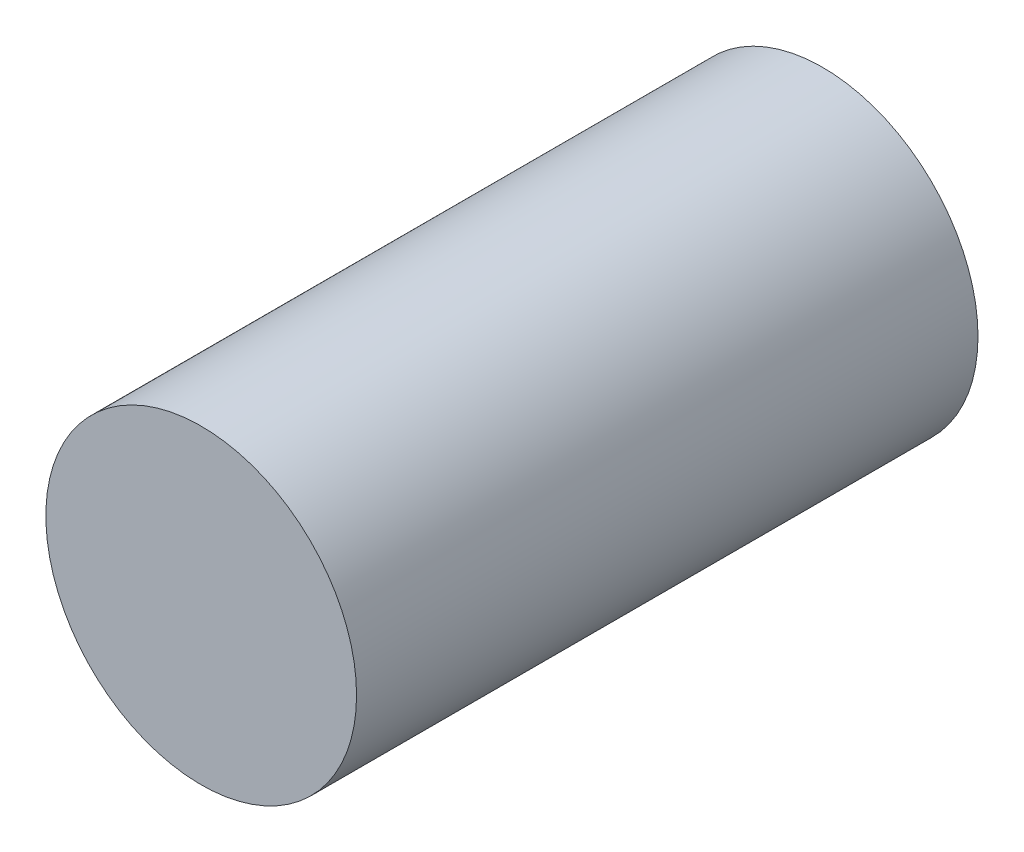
ISO-10303-21;
HEADER;
FILE_DESCRIPTION(('STEP AP214'),'2;1');
FILE_NAME('part.step','',(''),(''),'','','');
FILE_SCHEMA(('AUTOMOTIVE_DESIGN { 1 0 10303 214 1 1 1 1 }'));
ENDSEC;
DATA;
#1=APPLICATION_CONTEXT('core data for automotive mechanical design processes');
#2=APPLICATION_PROTOCOL_DEFINITION('international standard','automotive_design',2000,#1);
#3=PRODUCT_CONTEXT('',#1,'mechanical');
#4=PRODUCT('Part','Part','',(#3));
#5=PRODUCT_RELATED_PRODUCT_CATEGORY('part','',(#4));
#6=PRODUCT_DEFINITION_FORMATION('','',#4);
#7=PRODUCT_DEFINITION_CONTEXT('part definition',#1,'design');
#8=PRODUCT_DEFINITION('design','',#6,#7);
#9=PRODUCT_DEFINITION_SHAPE('','',#8);
#10=(LENGTH_UNIT() NAMED_UNIT(*) SI_UNIT(.MILLI.,.METRE.));
#11=(NAMED_UNIT(*) PLANE_ANGLE_UNIT() SI_UNIT($,.RADIAN.));
#12=(NAMED_UNIT(*) SI_UNIT($,.STERADIAN.) SOLID_ANGLE_UNIT());
#13=UNCERTAINTY_MEASURE_WITH_UNIT(LENGTH_MEASURE(1.E-05),#10,'distance_accuracy_value','');
#14=(GEOMETRIC_REPRESENTATION_CONTEXT(3) GLOBAL_UNCERTAINTY_ASSIGNED_CONTEXT((#13)) GLOBAL_UNIT_ASSIGNED_CONTEXT((#10,
#11,#12)) REPRESENTATION_CONTEXT('',''));
#15=CARTESIAN_POINT('',(0.,0.,0.));
#16=DIRECTION('',(0.,0.,1.));
#17=DIRECTION('',(1.,0.,0.));
#18=AXIS2_PLACEMENT_3D('',#15,#16,#17);
#19=CARTESIAN_POINT('',(0.,0.,200.));
#20=DIRECTION('',(0.,0.,-1.));
#21=DIRECTION('',(-1.,0.,0.));
#22=AXIS2_PLACEMENT_3D('',#19,#20,#21);
#23=CYLINDRICAL_SURFACE('',#22,50.);
#24=DIRECTION('',(0.,0.,-1.));
#25=VECTOR('',#24,1.);
#26=CARTESIAN_POINT('',(-49.9076236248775,-3.03794406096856,175.));
#27=LINE('',#26,#25);
#28=CARTESIAN_POINT('',(-49.9076236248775,-3.03794406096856,175.));
#29=VERTEX_POINT('',#28);
#30=CARTESIAN_POINT('',(-49.9076236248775,-3.03794406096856,142.642135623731));
#31=VERTEX_POINT('',#30);
#32=EDGE_CURVE('E209',#29,#31,#27,.T.);
#33=ORIENTED_EDGE('',*,*,#32,.T.);
#34=CARTESIAN_POINT('',(-49.8686076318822,-3.62242637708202,141.227922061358));
#35=CARTESIAN_POINT('',(-49.8821987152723,-3.43532294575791,141.415568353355));
#36=CARTESIAN_POINT('',(-49.8916710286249,-3.29111696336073,141.631850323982));
#37=CARTESIAN_POINT('',(-49.9046135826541,-3.08866185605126,142.121687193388));
#38=CARTESIAN_POINT('',(-49.9075997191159,-3.03833678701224,142.375402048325));
#39=CARTESIAN_POINT('',(-49.9076236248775,-3.03794406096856,142.642135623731));
#40=B_SPLINE_CURVE_WITH_KNOTS('',3,(#34,#35,#36,#37,#38,#39),.UNSPECIFIED.,.F.,.F.,(4,2,4),(0.,
0.5,1.),.UNSPECIFIED.);
#41=CARTESIAN_POINT('',(-49.8686076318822,-3.62242637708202,141.227922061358));
#42=VERTEX_POINT('',#41);
#43=EDGE_CURVE('E112',#31,#42,#40,.F.);
#44=ORIENTED_EDGE('',*,*,#43,.T.);
#45=CARTESIAN_POINT('',(0.656835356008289,-49.9956854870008,65.6568542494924));
#46=CARTESIAN_POINT('',(-2.4917027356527,-50.0370504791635,68.8056640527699));
#47=CARTESIAN_POINT('',(-5.6440625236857,-49.7801111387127,71.9544432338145));
#48=CARTESIAN_POINT('',(-11.8445967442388,-48.6787472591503,78.2520322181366));
#49=CARTESIAN_POINT('',(-14.8926244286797,-47.8343458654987,81.4008267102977));
#50=CARTESIAN_POINT('',(-20.7759850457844,-45.588083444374,87.6984156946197));
#51=CARTESIAN_POINT('',(-23.6111932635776,-44.1862700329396,90.8472101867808));
#52=CARTESIAN_POINT('',(-28.968005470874,-40.8750482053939,97.1447991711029));
#53=CARTESIAN_POINT('',(-31.4894959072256,-38.9657099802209,100.293593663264));
#54=CARTESIAN_POINT('',(-36.1291235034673,-34.7073672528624,106.591182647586));
#55=CARTESIAN_POINT('',(-38.2471623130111,-32.3584530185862,109.739977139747));
#56=CARTESIAN_POINT('',(-42.0044919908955,-27.3045336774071,116.037566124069));
#57=CARTESIAN_POINT('',(-43.6437032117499,-24.5996357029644,119.18636061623));
#58=CARTESIAN_POINT('',(-46.3850205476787,-18.9299967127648,125.483949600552));
#59=CARTESIAN_POINT('',(-47.4870685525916,-15.9653758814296,128.632744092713));
#60=CARTESIAN_POINT('',(-49.1148165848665,-9.88178620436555,134.930333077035));
#61=CARTESIAN_POINT('',(-49.6404809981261,-6.76296158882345,138.07911225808));
#62=CARTESIAN_POINT('',(-49.8686076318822,-3.62242637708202,141.227922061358));
#63=B_SPLINE_CURVE_WITH_KNOTS('',3,(#45,#46,#47,#48,#49,#50,#51,#52,#53,#54,#55,#56,#57,#58,#59,
#60,#61,#62),.UNSPECIFIED.,.F.,.F.,(4,2,2,2,2,2,2,2,4),(0.,0.125,0.25,0.375,0.5,0.625,0.75,
0.875,1.),.UNSPECIFIED.);
#64=CARTESIAN_POINT('',(0.656835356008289,-49.9956854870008,65.6568542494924));
#65=VERTEX_POINT('',#64);
#66=EDGE_CURVE('E676',#42,#65,#63,.F.);
#67=ORIENTED_EDGE('',*,*,#66,.T.);
#68=CARTESIAN_POINT('',(2.99820032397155,-49.9100269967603,60.));
#69=CARTESIAN_POINT('',(2.996361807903,-49.9101374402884,60.1686914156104));
#70=CARTESIAN_POINT('',(2.99329266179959,-49.9103217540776,60.2994722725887));
#71=CARTESIAN_POINT('',(2.98872410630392,-49.9105953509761,60.3981469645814));
#72=CARTESIAN_POINT('',(2.98822835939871,-49.9106250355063,60.4085616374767));
#73=CARTESIAN_POINT('',(2.98742277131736,-49.9106732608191,60.4247900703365));
#74=CARTESIAN_POINT('',(2.98700627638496,-49.9106981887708,60.4329074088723));
#75=CARTESIAN_POINT('',(2.9857156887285,-49.9107754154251,60.4572687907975));
#76=CARTESIAN_POINT('',(2.98480049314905,-49.9108301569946,60.4735222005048));
#77=CARTESIAN_POINT('',(2.9818904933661,-49.9110041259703,60.5223198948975));
#78=CARTESIAN_POINT('',(2.97973127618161,-49.9111330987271,60.5549016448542));
#79=CARTESIAN_POINT('',(2.97259595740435,-49.911558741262,60.6527967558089));
#80=CARTESIAN_POINT('',(2.9669621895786,-49.9118941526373,60.7182599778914));
#81=CARTESIAN_POINT('',(2.94743006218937,-49.9130526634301,60.9152490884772));
#82=CARTESIAN_POINT('',(2.93161902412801,-49.9139858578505,61.0420385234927));
#83=CARTESIAN_POINT('',(2.89298999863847,-49.9162396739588,61.3009320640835));
#84=CARTESIAN_POINT('',(2.87040977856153,-49.917546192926,61.4306381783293));
#85=CARTESIAN_POINT('',(2.74117641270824,-49.9249103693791,62.0804654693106));
#86=CARTESIAN_POINT('',(2.59011517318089,-49.9332689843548,62.578912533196));
#87=CARTESIAN_POINT('',(2.2902781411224,-49.9476189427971,63.3027017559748));
#88=CARTESIAN_POINT('',(2.17908219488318,-49.952649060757,63.5374437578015));
#89=CARTESIAN_POINT('',(1.92991438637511,-49.962896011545,64.0041635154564));
#90=CARTESIAN_POINT('',(1.79456852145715,-49.9679871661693,64.2315598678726));
#91=CARTESIAN_POINT('',(1.58140203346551,-49.9750359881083,64.552471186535));
#92=CARTESIAN_POINT('',(1.50391421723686,-49.9774388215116,64.662439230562));
#93=CARTESIAN_POINT('',(1.34714518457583,-49.9819102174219,64.8717022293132));
#94=CARTESIAN_POINT('',(1.26601863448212,-49.9840397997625,64.9737752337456));
#95=CARTESIAN_POINT('',(1.17166638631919,-49.9862711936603,65.0857290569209));
#96=CARTESIAN_POINT('',(1.16324475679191,-49.9864677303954,65.0956570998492));
#97=CARTESIAN_POINT('',(1.14380502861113,-49.9869163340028,65.1184647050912));
#98=CARTESIAN_POINT('',(1.13390699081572,-49.9871419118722,65.1300152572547));
#99=CARTESIAN_POINT('',(1.10367833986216,-49.9878215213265,65.1651071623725));
#100=CARTESIAN_POINT('',(1.0828131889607,-49.9882784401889,65.1890887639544));
#101=CARTESIAN_POINT('',(1.0180794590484,-49.9896527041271,65.26279456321));
#102=CARTESIAN_POINT('',(0.972072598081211,-49.9905737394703,65.3142797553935));
#103=CARTESIAN_POINT('',(0.920160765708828,-49.9915324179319,65.371477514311));
#104=CARTESIAN_POINT('',(0.919521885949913,-49.9915441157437,65.3721799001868));
#105=CARTESIAN_POINT('',(0.915740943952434,-49.9916135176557,65.3763396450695));
#106=CARTESIAN_POINT('',(0.913820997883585,-49.9916486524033,65.3784504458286));
#107=CARTESIAN_POINT('',(0.907972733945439,-49.9917553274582,65.3848756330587));
#108=CARTESIAN_POINT('',(0.903955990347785,-49.9918281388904,65.3892828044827));
#109=CARTESIAN_POINT('',(0.891552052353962,-49.9920514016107,65.4028754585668));
#110=CARTESIAN_POINT('',(0.882811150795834,-49.9922066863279,65.4124320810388));
#111=CARTESIAN_POINT('',(0.855173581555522,-49.9926896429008,65.4425865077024));
#112=CARTESIAN_POINT('',(0.834862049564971,-49.9930344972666,65.4646688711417));
#113=CARTESIAN_POINT('',(0.768267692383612,-49.9941170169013,65.5368541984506));
#114=CARTESIAN_POINT('',(0.716325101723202,-49.994903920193,65.5928953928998));
#115=CARTESIAN_POINT('',(0.656835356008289,-49.9956854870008,65.6568542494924));
#116=B_SPLINE_CURVE_WITH_KNOTS('',3,(#68,#69,#70,#71,#72,#73,#74,#75,#76,#77,#78,#79,#80,#81,
#82,#83,#84,#85,#86,#87,#88,#89,#90,#91,#92,#93,#94,#95,#96,#97,#98,#99,#100,#101,#102,#103,
#104,#105,#106,#107,#108,#109,#110,#111,#112,#113,#114,#115),.UNSPECIFIED.,.F.,.F.,(4,2,2,2,2,2,
2,2,2,2,2,2,2,2,2,2,2,2,2,2,2,2,2,4),(0.,0.0625,0.06640625,0.0703125,0.078125,0.09375,0.125,
0.1875,0.25,0.5,0.625,0.75,0.8125,0.875,0.8828125,0.890625,0.90625,0.9375,0.939453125,
0.94140625,0.9453125,0.953125,0.96875,1.),.UNSPECIFIED.);
#117=CARTESIAN_POINT('',(2.99820032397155,-49.9100269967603,60.));
#118=VERTEX_POINT('',#117);
#119=EDGE_CURVE('E378',#65,#118,#116,.F.);
#120=ORIENTED_EDGE('',*,*,#119,.T.);
#121=DIRECTION('',(0.,0.,-1.));
#122=VECTOR('',#121,1.);
#123=CARTESIAN_POINT('',(2.99820032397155,-49.9100269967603,60.));
#124=LINE('',#123,#122);
#125=CARTESIAN_POINT('',(2.99820032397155,-49.9100269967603,25.));
#126=VERTEX_POINT('',#125);
#127=EDGE_CURVE('E374',#118,#126,#124,.T.);
#128=ORIENTED_EDGE('',*,*,#127,.T.);
#129=CARTESIAN_POINT('',(-2.99820032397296,-49.9100269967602,25.));
#130=CARTESIAN_POINT('',(-2.99311947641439,-49.9103322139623,24.8695460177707));
#131=CARTESIAN_POINT('',(-2.98789558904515,-49.9106452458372,24.7719265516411));
#132=CARTESIAN_POINT('',(-2.9821932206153,-49.9109860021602,24.7030925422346));
#133=CARTESIAN_POINT('',(-2.98147731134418,-49.9110287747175,24.6946948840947));
#134=CARTESIAN_POINT('',(-2.98036799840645,-49.9110950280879,24.6822809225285));
#135=CARTESIAN_POINT('',(-2.97979401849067,-49.9111292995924,24.6760848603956));
#136=CARTESIAN_POINT('',(-2.97801410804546,-49.9112355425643,24.6575294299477));
#137=CARTESIAN_POINT('',(-2.97675020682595,-49.9113109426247,24.6452028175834));
#138=CARTESIAN_POINT('',(-2.97272661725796,-49.9115508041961,24.6083540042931));
#139=CARTESIAN_POINT('',(-2.96973504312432,-49.9117289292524,24.5839628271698));
#140=CARTESIAN_POINT('',(-2.95983274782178,-49.9123174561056,24.511313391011));
#141=CARTESIAN_POINT('',(-2.95199445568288,-49.9127820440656,24.4635792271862));
#142=CARTESIAN_POINT('',(-2.90661867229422,-49.9154574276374,24.2284023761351));
#143=CARTESIAN_POINT('',(-2.84916505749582,-49.9188168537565,24.0386752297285));
#144=CARTESIAN_POINT('',(-2.7329841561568,-49.9252671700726,23.760757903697));
#145=CARTESIAN_POINT('',(-2.69151286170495,-49.9275266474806,23.6737829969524));
#146=CARTESIAN_POINT('',(-2.59872108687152,-49.9324424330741,23.5007383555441));
#147=CARTESIAN_POINT('',(-2.54812682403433,-49.9350584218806,23.4164058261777));
#148=CARTESIAN_POINT('',(-2.38374370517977,-49.9432658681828,23.1699776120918));
#149=CARTESIAN_POINT('',(-2.25954720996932,-49.9491095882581,23.0180236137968));
#150=CARTESIAN_POINT('',(-1.84528788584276,-49.9667021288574,22.602434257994));
#151=CARTESIAN_POINT('',(-1.51207083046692,-49.9784520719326,22.3792513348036));
#152=CARTESIAN_POINT('',(-0.785544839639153,-49.99514925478,22.0782495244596));
#153=CARTESIAN_POINT('',(-0.394812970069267,-49.9999933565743,22.0000670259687));
#154=CARTESIAN_POINT('',(0.393128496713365,-50.0000066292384,22.0000851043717));
#155=CARTESIAN_POINT('',(0.782857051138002,-49.9952027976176,22.077205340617));
#156=CARTESIAN_POINT('',(1.51250840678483,-49.9784502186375,22.3792697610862));
#157=CARTESIAN_POINT('',(1.83678668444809,-49.9670501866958,22.5962048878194));
#158=CARTESIAN_POINT('',(2.26037715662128,-49.9490807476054,23.0196206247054));
#159=CARTESIAN_POINT('',(2.38479748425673,-49.9432175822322,23.1702045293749));
#160=CARTESIAN_POINT('',(2.52292682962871,-49.9363154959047,23.3737992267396));
#161=CARTESIAN_POINT('',(2.55113562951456,-49.9348813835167,23.417645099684));
#162=CARTESIAN_POINT('',(2.60290440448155,-49.9322096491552,23.5030193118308));
#163=CARTESIAN_POINT('',(2.62743359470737,-49.9309235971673,23.5459762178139));
#164=CARTESIAN_POINT('',(2.6969564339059,-49.9272328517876,23.6756563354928));
#165=CARTESIAN_POINT('',(2.7378853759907,-49.9249962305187,23.763188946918));
#166=CARTESIAN_POINT('',(2.80890811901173,-49.9210506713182,23.9404125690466));
#167=CARTESIAN_POINT('',(2.84016584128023,-49.9192758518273,24.0342124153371));
#168=CARTESIAN_POINT('',(2.87182474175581,-49.917458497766,24.152711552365));
#169=CARTESIAN_POINT('',(2.87703381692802,-49.9171584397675,24.1733638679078));
#170=CARTESIAN_POINT('',(2.88802180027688,-49.9165239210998,24.2191108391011));
#171=CARTESIAN_POINT('',(2.8933315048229,-49.9162163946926,24.2424492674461));
#172=CARTESIAN_POINT('',(2.90870778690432,-49.9153235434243,24.313859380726));
#173=CARTESIAN_POINT('',(2.91822153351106,-49.9147679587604,24.3633258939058));
#174=CARTESIAN_POINT('',(2.92919242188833,-49.9141246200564,24.4274837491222));
#175=CARTESIAN_POINT('',(2.93064624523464,-49.9140392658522,24.4362606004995));
#176=CARTESIAN_POINT('',(2.93424433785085,-49.9138278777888,24.4584017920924));
#177=CARTESIAN_POINT('',(2.93602674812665,-49.9137230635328,24.4696499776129));
#178=CARTESIAN_POINT('',(2.94132407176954,-49.9134112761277,24.5039273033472));
#179=CARTESIAN_POINT('',(2.94478907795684,-49.9132069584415,24.5274892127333));
#180=CARTESIAN_POINT('',(2.95498447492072,-49.9126047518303,24.6003060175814));
#181=CARTESIAN_POINT('',(2.96151524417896,-49.9122176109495,24.6516919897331));
#182=CARTESIAN_POINT('',(2.96856294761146,-49.9117985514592,24.7126978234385));
#183=CARTESIAN_POINT('',(2.96873229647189,-49.9117884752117,24.7142037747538));
#184=CARTESIAN_POINT('',(2.96971521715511,-49.911730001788,24.722872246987));
#185=CARTESIAN_POINT('',(2.97021684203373,-49.911700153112,24.7273345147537));
#186=CARTESIAN_POINT('',(2.9717522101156,-49.9116087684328,24.7411054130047));
#187=CARTESIAN_POINT('',(2.97281644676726,-49.911545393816,24.7507981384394));
#188=CARTESIAN_POINT('',(2.97613112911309,-49.9113478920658,24.781412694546));
#189=CARTESIAN_POINT('',(2.9785035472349,-49.9112063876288,24.8038709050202));
#190=CARTESIAN_POINT('',(2.98610867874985,-49.9107521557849,24.8773910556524));
#191=CARTESIAN_POINT('',(2.99182926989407,-49.9104097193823,24.9345985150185));
#192=CARTESIAN_POINT('',(2.99820032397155,-49.9100269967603,25.));
#193=B_SPLINE_CURVE_WITH_KNOTS('',3,(#129,#130,#131,#132,#133,#134,#135,#136,#137,#138,#139,
#140,#141,#142,#143,#144,#145,#146,#147,#148,#149,#150,#151,#152,#153,#154,#155,#156,#157,#158,
#159,#160,#161,#162,#163,#164,#165,#166,#167,#168,#169,#170,#171,#172,#173,#174,#175,#176,#177,
#178,#179,#180,#181,#182,#183,#184,#185,#186,#187,#188,#189,#190,#191,#192),.UNSPECIFIED.,.F.,
.F.,(4,2,2,2,2,2,2,2,2,2,2,2,2,2,2,2,2,2,2,2,2,2,2,2,2,2,2,2,2,2,2,4),(0.,0.03125,0.033203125,
0.03515625,0.0390625,0.046875,0.0625,0.125,0.15625,0.1875,0.25,0.375,0.5,0.625,0.75,0.8125,
0.828125,0.84375,0.875,0.90625,0.9140625,0.921875,0.9375,0.94140625,0.9453125,0.953125,0.96875,
0.970703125,0.97265625,0.9765625,0.984375,1.),.UNSPECIFIED.);
#194=CARTESIAN_POINT('',(-2.99820032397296,-49.9100269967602,25.));
#195=VERTEX_POINT('',#194);
#196=EDGE_CURVE('E377',#126,#195,#193,.F.);
#197=ORIENTED_EDGE('',*,*,#196,.T.);
#198=DIRECTION('',(0.,0.,1.));
#199=VECTOR('',#198,1.);
#200=CARTESIAN_POINT('',(-2.99820032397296,-49.9100269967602,25.));
#201=LINE('',#200,#199);
#202=CARTESIAN_POINT('',(-2.99820032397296,-49.9100269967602,60.));
#203=VERTEX_POINT('',#202);
#204=EDGE_CURVE('E534',#195,#203,#201,.T.);
#205=ORIENTED_EDGE('',*,*,#204,.T.);
#206=CARTESIAN_POINT('',(-3.582713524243,-49.8714764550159,61.4142135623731));
#207=CARTESIAN_POINT('',(-3.39559932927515,-49.8849185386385,61.2265672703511));
#208=CARTESIAN_POINT('',(-3.25138584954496,-49.8942760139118,61.0102852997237));
#209=CARTESIAN_POINT('',(-3.04892049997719,-49.9070573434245,60.5204484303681));
#210=CARTESIAN_POINT('',(-2.99859306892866,-49.9100034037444,60.2667335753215));
#211=CARTESIAN_POINT('',(-2.99820032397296,-49.9100269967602,60.));
#212=B_SPLINE_CURVE_WITH_KNOTS('',3,(#206,#207,#208,#209,#210,#211),.UNSPECIFIED.,.F.,.F.,(4,2,
4),(0.,0.5,1.),.UNSPECIFIED.);
#213=CARTESIAN_POINT('',(-3.582713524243,-49.8714764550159,61.4142135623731));
#214=VERTEX_POINT('',#213);
#215=EDGE_CURVE('E537',#203,#214,#212,.F.);
#216=ORIENTED_EDGE('',*,*,#215,.T.);
#217=CARTESIAN_POINT('',(-49.996192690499,0.617022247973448,136.985281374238));
#218=CARTESIAN_POINT('',(-50.0350504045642,-2.53154778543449,133.836471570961));
#219=CARTESIAN_POINT('',(-49.7756008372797,-5.68370196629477,130.687692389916));
#220=CARTESIAN_POINT('',(-48.6692996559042,-11.8833571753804,124.390103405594));
#221=CARTESIAN_POINT('',(-47.8224713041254,-14.9307114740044,121.241308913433));
#222=CARTESIAN_POINT('',(-45.5715245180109,-20.8122814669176,114.943719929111));
#223=CARTESIAN_POINT('',(-44.1674537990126,-23.6463724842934,111.79492543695));
#224=CARTESIAN_POINT('',(-40.8519672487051,-29.000546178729,105.497336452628));
#225=CARTESIAN_POINT('',(-38.9406216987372,-31.5205153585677,102.348541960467));
#226=CARTESIAN_POINT('',(-34.678585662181,-36.1567504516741,96.0509529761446));
#227=CARTESIAN_POINT('',(-32.3279855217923,-38.2729180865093,92.9021584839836));
#228=CARTESIAN_POINT('',(-27.2710757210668,-42.026222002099,86.6045694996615));
#229=CARTESIAN_POINT('',(-24.5648732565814,-43.6632787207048,83.4557750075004));
#230=CARTESIAN_POINT('',(-18.8930530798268,-46.4000803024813,77.1581860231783));
#231=CARTESIAN_POINT('',(-15.9275555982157,-47.4997671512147,74.0093915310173));
#232=CARTESIAN_POINT('',(-9.84267163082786,-49.1226701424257,67.7118025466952));
#233=CARTESIAN_POINT('',(-6.72342940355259,-49.6458507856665,64.5630233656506));
#234=CARTESIAN_POINT('',(-3.582713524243,-49.8714764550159,61.4142135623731));
#235=B_SPLINE_CURVE_WITH_KNOTS('',3,(#217,#218,#219,#220,#221,#222,#223,#224,#225,#226,#227,
#228,#229,#230,#231,#232,#233,#234),.UNSPECIFIED.,.F.,.F.,(4,2,2,2,2,2,2,2,4),(0.,0.125,0.25,
0.375,0.5,0.625,0.75,0.875,1.),.UNSPECIFIED.);
#236=CARTESIAN_POINT('',(-49.996192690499,0.617022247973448,136.985281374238));
#237=VERTEX_POINT('',#236);
#238=EDGE_CURVE('E220',#214,#237,#235,.F.);
#239=ORIENTED_EDGE('',*,*,#238,.T.);
#240=CARTESIAN_POINT('',(-49.9123987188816,2.95845468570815,142.642135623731));
#241=CARTESIAN_POINT('',(-49.9125076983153,2.95661608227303,142.473444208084));
#242=CARTESIAN_POINT('',(-49.912689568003,2.95354679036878,142.342663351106));
#243=CARTESIAN_POINT('',(-49.912959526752,2.94897801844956,142.243988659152));
#244=CARTESIAN_POINT('',(-49.9129888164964,2.94848224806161,142.23357398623));
#245=CARTESIAN_POINT('',(-49.9130364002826,2.94767662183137,142.217345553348));
#246=CARTESIAN_POINT('',(-49.9130609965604,2.94726010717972,142.209228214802));
#247=CARTESIAN_POINT('',(-49.9131371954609,2.94596945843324,142.184866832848));
#248=CARTESIAN_POINT('',(-49.9131912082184,2.94505421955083,142.168613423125));
#249=CARTESIAN_POINT('',(-49.9133628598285,2.94214408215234,142.119815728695));
#250=CARTESIAN_POINT('',(-49.9134901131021,2.93998476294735,142.087233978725));
#251=CARTESIAN_POINT('',(-49.9139100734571,2.93284910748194,141.989338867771));
#252=CARTESIAN_POINT('',(-49.9142409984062,2.92721507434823,141.923875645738));
#253=CARTESIAN_POINT('',(-49.9153839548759,2.90768203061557,141.726886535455));
#254=CARTESIAN_POINT('',(-49.91630455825,2.89187025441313,141.600097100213));
#255=CARTESIAN_POINT('',(-49.9185276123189,2.85323944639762,141.341203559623));
#256=CARTESIAN_POINT('',(-49.9198161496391,2.83065819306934,141.211497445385));
#257=CARTESIAN_POINT('',(-49.9270774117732,2.701419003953,140.561670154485));
#258=CARTESIAN_POINT('',(-49.9353157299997,2.55035115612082,140.063223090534));
#259=CARTESIAN_POINT('',(-49.9494269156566,2.25050279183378,139.339433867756));
#260=CARTESIAN_POINT('',(-49.9543684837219,2.13930287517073,139.104691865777));
#261=CARTESIAN_POINT('',(-49.9644170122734,1.89012698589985,138.637972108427));
#262=CARTESIAN_POINT('',(-49.9694003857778,1.75477710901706,138.410575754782));
#263=CARTESIAN_POINT('',(-49.9762794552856,1.54160507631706,138.089664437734));
#264=CARTESIAN_POINT('',(-49.9786205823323,1.46411537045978,137.979696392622));
#265=CARTESIAN_POINT('',(-49.9829671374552,1.30734282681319,137.770433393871));
#266=CARTESIAN_POINT('',(-49.9850321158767,1.22621460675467,137.668360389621));
#267=CARTESIAN_POINT('',(-49.9871883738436,1.13186061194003,137.556406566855));
#268=CARTESIAN_POINT('',(-49.9873782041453,1.12343882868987,137.546478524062));
#269=CARTESIAN_POINT('',(-49.9878113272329,1.10399874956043,137.523670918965));
#270=CARTESIAN_POINT('',(-49.9880290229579,1.09410053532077,137.512120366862));
#271=CARTESIAN_POINT('',(-49.9886845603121,1.06387135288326,137.477028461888));
#272=CARTESIAN_POINT('',(-49.989124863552,1.04300584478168,137.453046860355));
#273=CARTESIAN_POINT('',(-49.9904475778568,0.978271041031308,137.379341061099));
#274=CARTESIAN_POINT('',(-49.9913319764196,0.932263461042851,137.327855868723));
#275=CARTESIAN_POINT('',(-49.9922493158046,0.880350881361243,137.270658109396));
#276=CARTESIAN_POINT('',(-49.9922605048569,0.879711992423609,137.269955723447));
#277=CARTESIAN_POINT('',(-49.9923268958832,0.875930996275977,137.265795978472));
#278=CARTESIAN_POINT('',(-49.992360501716,0.874011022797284,137.263685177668));
#279=CARTESIAN_POINT('',(-49.9924625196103,0.868162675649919,137.257259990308));
#280=CARTESIAN_POINT('',(-49.9925321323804,0.864145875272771,137.252852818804));
#281=CARTESIAN_POINT('',(-49.9927455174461,0.851741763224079,137.239260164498));
#282=CARTESIAN_POINT('',(-49.9928938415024,0.843000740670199,137.229703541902));
#283=CARTESIAN_POINT('',(-49.9933547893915,0.815362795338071,137.199549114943));
#284=CARTESIAN_POINT('',(-49.9936834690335,0.795050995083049,137.177466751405));
#285=CARTESIAN_POINT('',(-49.9947129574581,0.728455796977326,137.105281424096));
#286=CARTESIAN_POINT('',(-49.9954584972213,0.676512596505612,137.049240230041));
#287=CARTESIAN_POINT('',(-49.996192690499,0.617022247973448,136.985281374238));
#288=B_SPLINE_CURVE_WITH_KNOTS('',3,(#240,#241,#242,#243,#244,#245,#246,#247,#248,#249,#250,
#251,#252,#253,#254,#255,#256,#257,#258,#259,#260,#261,#262,#263,#264,#265,#266,#267,#268,#269,
#270,#271,#272,#273,#274,#275,#276,#277,#278,#279,#280,#281,#282,#283,#284,#285,#286,#287),
.UNSPECIFIED.,.F.,.F.,(4,2,2,2,2,2,2,2,2,2,2,2,2,2,2,2,2,2,2,2,2,2,2,4),(0.,0.0625,0.06640625,
0.0703125,0.078125,0.09375,0.125,0.1875,0.25,0.5,0.625,0.75,0.8125,0.875,0.8828125,0.890625,
0.90625,0.9375,0.939453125,0.94140625,0.9453125,0.953125,0.96875,1.),.UNSPECIFIED.);
#289=CARTESIAN_POINT('',(-49.9123987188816,2.95845468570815,142.642135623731));
#290=VERTEX_POINT('',#289);
#291=EDGE_CURVE('E215',#237,#290,#288,.F.);
#292=ORIENTED_EDGE('',*,*,#291,.T.);
#293=DIRECTION('',(0.,0.,1.));
#294=VECTOR('',#293,1.);
#295=CARTESIAN_POINT('',(-49.9123987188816,2.95845468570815,142.642135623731));
#296=LINE('',#295,#294);
#297=CARTESIAN_POINT('',(-49.9123987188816,2.95845468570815,175.));
#298=VERTEX_POINT('',#297);
#299=EDGE_CURVE('E192',#290,#298,#296,.T.);
#300=ORIENTED_EDGE('',*,*,#299,.T.);
#301=CARTESIAN_POINT('',(-49.9076236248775,-3.03794406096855,175.));
#302=CARTESIAN_POINT('',(-49.9079328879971,-3.03286345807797,175.130453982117));
#303=CARTESIAN_POINT('',(-49.9082500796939,-3.02763982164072,175.228073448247));
#304=CARTESIAN_POINT('',(-49.9085953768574,-3.02193772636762,175.296907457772));
#305=CARTESIAN_POINT('',(-49.9086387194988,-3.02122185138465,175.305305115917));
#306=CARTESIAN_POINT('',(-49.9087058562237,-3.02011259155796,175.317719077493));
#307=CARTESIAN_POINT('',(-49.9087405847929,-3.01953863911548,175.323915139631));
#308=CARTESIAN_POINT('',(-49.9088482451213,-3.01775881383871,175.342470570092));
#309=CARTESIAN_POINT('',(-49.9089246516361,-3.01649497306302,175.354797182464));
#310=CARTESIAN_POINT('',(-49.9091677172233,-3.01247157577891,175.391645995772));
#311=CARTESIAN_POINT('',(-49.9093482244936,-3.00948014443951,175.416037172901));
#312=CARTESIAN_POINT('',(-49.9099446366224,-2.99957832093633,175.48868660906));
#313=CARTESIAN_POINT('',(-49.9104154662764,-2.99174040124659,175.536420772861));
#314=CARTESIAN_POINT('',(-49.9131269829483,-2.94636676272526,175.771597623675));
#315=CARTESIAN_POINT('',(-49.9165321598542,-2.88891584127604,175.961324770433));
#316=CARTESIAN_POINT('',(-49.9230749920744,-2.77274011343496,176.239242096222));
#317=CARTESIAN_POINT('',(-49.9253674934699,-2.73127063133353,176.32621700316));
#318=CARTESIAN_POINT('',(-49.9303571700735,-2.63848280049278,176.499261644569));
#319=CARTESIAN_POINT('',(-49.9330134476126,-2.58789063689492,176.583594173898));
#320=CARTESIAN_POINT('',(-49.941351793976,-2.42351410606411,176.830022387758));
#321=CARTESIAN_POINT('',(-49.9472944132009,-2.29932230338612,176.981976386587));
#322=CARTESIAN_POINT('',(-49.965216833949,-1.8850771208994,177.397565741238));
#323=CARTESIAN_POINT('',(-49.9772321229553,-1.55186952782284,177.620748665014));
#324=CARTESIAN_POINT('',(-49.994507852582,-0.825357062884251,177.921750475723));
#325=CARTESIAN_POINT('',(-49.9996631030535,-0.434629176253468,177.999932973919));
#326=CARTESIAN_POINT('',(-50.0003038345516,0.353312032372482,177.99991489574));
#327=CARTESIAN_POINT('',(-49.9958047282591,0.743269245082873,177.922719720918));
#328=CARTESIAN_POINT('',(-49.9796483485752,1.47230789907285,177.620880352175));
#329=CARTESIAN_POINT('',(-49.9684942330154,1.79706310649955,177.403728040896));
#330=CARTESIAN_POINT('',(-49.9508663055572,2.22056710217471,176.980412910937));
#331=CARTESIAN_POINT('',(-49.9451008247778,2.34502560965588,176.829795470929));
#332=CARTESIAN_POINT('',(-49.938308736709,2.48316040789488,176.626200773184));
#333=CARTESIAN_POINT('',(-49.9368970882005,2.51137034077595,176.582354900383));
#334=CARTESIAN_POINT('',(-49.9342665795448,2.56314122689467,176.496980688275));
#335=CARTESIAN_POINT('',(-49.9330000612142,2.58767143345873,176.454023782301));
#336=CARTESIAN_POINT('',(-49.9293646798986,2.65719718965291,176.324343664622));
#337=CARTESIAN_POINT('',(-49.9271606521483,2.69812789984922,176.236811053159));
#338=CARTESIAN_POINT('',(-49.9232716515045,2.76915376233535,176.059587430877));
#339=CARTESIAN_POINT('',(-49.9215217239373,2.80041288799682,175.965787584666));
#340=CARTESIAN_POINT('',(-49.9197295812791,2.83207322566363,175.847288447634));
#341=CARTESIAN_POINT('',(-49.9194336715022,2.83728253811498,175.826636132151));
#342=CARTESIAN_POINT('',(-49.9188079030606,2.84827102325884,175.780889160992));
#343=CARTESIAN_POINT('',(-49.9185046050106,2.85358097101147,175.757550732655));
#344=CARTESIAN_POINT('',(-49.9176239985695,2.86895795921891,175.686140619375));
#345=CARTESIAN_POINT('',(-49.917075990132,2.87847214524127,175.636674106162));
#346=CARTESIAN_POINT('',(-49.9164413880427,2.88944354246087,175.572516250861));
#347=CARTESIAN_POINT('',(-49.9163571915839,2.8908974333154,175.563739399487));
#348=CARTESIAN_POINT('',(-49.9161486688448,2.89449569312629,175.541598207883));
#349=CARTESIAN_POINT('',(-49.9160452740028,2.89627818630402,175.530350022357));
#350=CARTESIAN_POINT('',(-49.9157377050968,2.90157575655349,175.496072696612));
#351=CARTESIAN_POINT('',(-49.9155361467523,2.90504092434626,175.472510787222));
#352=CARTESIAN_POINT('',(-49.914942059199,2.91523679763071,175.399693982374));
#353=CARTESIAN_POINT('',(-49.9145601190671,2.92176787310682,175.348308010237));
#354=CARTESIAN_POINT('',(-49.9141466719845,2.92881590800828,175.287302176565));
#355=CARTESIAN_POINT('',(-49.9141367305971,2.92898526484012,175.28579622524));
#356=CARTESIAN_POINT('',(-49.9140790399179,2.92996823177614,175.277127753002));
#357=CARTESIAN_POINT('',(-49.9140495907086,2.93046988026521,175.272665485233));
#358=CARTESIAN_POINT('',(-49.913959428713,2.93200532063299,175.258894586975));
#359=CARTESIAN_POINT('',(-49.9138969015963,2.9330696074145,175.249201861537));
#360=CARTESIAN_POINT('',(-49.9137020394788,2.93638444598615,175.218587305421));
#361=CARTESIAN_POINT('',(-49.9135624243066,2.93875697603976,175.196129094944));
#362=CARTESIAN_POINT('',(-49.913114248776,2.94636246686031,175.122608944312));
#363=CARTESIAN_POINT('',(-49.9127763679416,2.95208332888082,175.065401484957));
#364=CARTESIAN_POINT('',(-49.9123987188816,2.95845468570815,175.));
#365=B_SPLINE_CURVE_WITH_KNOTS('',3,(#301,#302,#303,#304,#305,#306,#307,#308,#309,#310,#311,
#312,#313,#314,#315,#316,#317,#318,#319,#320,#321,#322,#323,#324,#325,#326,#327,#328,#329,#330,
#331,#332,#333,#334,#335,#336,#337,#338,#339,#340,#341,#342,#343,#344,#345,#346,#347,#348,#349,
#350,#351,#352,#353,#354,#355,#356,#357,#358,#359,#360,#361,#362,#363,#364),.UNSPECIFIED.,.F.,
.F.,(4,2,2,2,2,2,2,2,2,2,2,2,2,2,2,2,2,2,2,2,2,2,2,2,2,2,2,2,2,2,2,4),(0.,0.03125,0.033203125,
0.03515625,0.0390625,0.046875,0.0625,0.125,0.15625,0.1875,0.25,0.375,0.5,0.625,0.75,0.8125,
0.828125,0.84375,0.875,0.90625,0.9140625,0.921875,0.9375,0.94140625,0.9453125,0.953125,0.96875,
0.970703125,0.97265625,0.9765625,0.984375,1.),.UNSPECIFIED.);
#366=EDGE_CURVE('E201',#298,#29,#365,.F.);
#367=ORIENTED_EDGE('',*,*,#366,.T.);
#368=EDGE_LOOP('',(#33,#44,#67,#120,#128,#197,#205,#216,#239,#292,#300,#367));
#369=FACE_BOUND('',#368,.T.);
#370=CARTESIAN_POINT('',(0.,0.,200.));
#371=DIRECTION('',(0.,0.,1.));
#372=DIRECTION('',(1.,0.,0.));
#373=AXIS2_PLACEMENT_3D('',#370,#371,#372);
#374=CIRCLE('',#373,50.);
#375=CARTESIAN_POINT('',(50.,0.,200.));
#376=VERTEX_POINT('',#375);
#377=EDGE_CURVE('E13',#376,#376,#374,.T.);
#378=ORIENTED_EDGE('',*,*,#377,.F.);
#379=EDGE_LOOP('',(#378));
#380=FACE_BOUND('',#379,.T.);
#381=CARTESIAN_POINT('',(0.,0.,0.));
#382=DIRECTION('',(0.,0.,1.));
#383=DIRECTION('',(1.,0.,0.));
#384=AXIS2_PLACEMENT_3D('',#381,#382,#383);
#385=CIRCLE('',#384,50.);
#386=CARTESIAN_POINT('',(50.,0.,0.));
#387=VERTEX_POINT('',#386);
#388=EDGE_CURVE('E104',#387,#387,#385,.T.);
#389=ORIENTED_EDGE('',*,*,#388,.T.);
#390=EDGE_LOOP('',(#389));
#391=FACE_BOUND('',#390,.T.);
#392=ADVANCED_FACE('F94',(#369,#380,#391),#23,.T.);
#393=CARTESIAN_POINT('',(0.,0.,200.));
#394=DIRECTION('',(0.,0.,1.));
#395=DIRECTION('',(1.,0.,0.));
#396=AXIS2_PLACEMENT_3D('',#393,#394,#395);
#397=PLANE('',#396);
#398=ORIENTED_EDGE('',*,*,#377,.T.);
#399=EDGE_LOOP('',(#398));
#400=FACE_BOUND('',#399,.T.);
#401=ADVANCED_FACE('F706',(#400),#397,.T.);
#402=CARTESIAN_POINT('',(0.,0.,0.));
#403=DIRECTION('',(0.,0.,1.));
#404=DIRECTION('',(1.,0.,0.));
#405=AXIS2_PLACEMENT_3D('',#402,#403,#404);
#406=PLANE('',#405);
#407=ORIENTED_EDGE('',*,*,#388,.F.);
#408=EDGE_LOOP('',(#407));
#409=FACE_BOUND('',#408,.T.);
#410=ADVANCED_FACE('F730',(#409),#406,.F.);
#411=CARTESIAN_POINT('',(-49.9076236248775,-3.03794406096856,142.642135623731));
#412=CARTESIAN_POINT('',(-49.9075997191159,-3.03833678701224,142.375402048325));
#413=CARTESIAN_POINT('',(-49.9046135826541,-3.08866185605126,142.121687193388));
#414=CARTESIAN_POINT('',(-49.8916710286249,-3.29111696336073,141.631850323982));
#415=CARTESIAN_POINT('',(-49.8821987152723,-3.43532294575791,141.415568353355));
#416=CARTESIAN_POINT('',(-49.8686076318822,-3.62242637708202,141.227922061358));
#417=CARTESIAN_POINT('',(-46.9131662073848,-2.85566741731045,142.642135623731));
#418=CARTESIAN_POINT('',(-46.9131437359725,-2.85603657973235,142.375402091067));
#419=CARTESIAN_POINT('',(-46.9103367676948,-2.90334214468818,142.121687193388));
#420=CARTESIAN_POINT('',(-46.8981707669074,-3.09364994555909,141.631850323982));
#421=CARTESIAN_POINT('',(-46.8892667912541,-3.22920358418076,141.415568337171));
#422=CARTESIAN_POINT('',(-46.8764911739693,-3.4050807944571,141.227922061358));
#423=B_SPLINE_SURFACE_WITH_KNOTS('',1,3,((#411,#412,#413,#414,#415,#416),(#417,#418,#419,#420,
#421,#422)),.UNSPECIFIED.,.F.,.F.,.F.,(2,2),(4,2,4),(0.,1.),(0.,0.5,1.),.UNSPECIFIED.);
#424=CARTESIAN_POINT('',(-49.9076236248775,-3.03794406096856,142.642135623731));
#425=CARTESIAN_POINT('',(-46.9131662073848,-2.85566741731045,142.642135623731));
#426=B_SPLINE_CURVE_WITH_KNOTS('',1,(#424,#425),.UNSPECIFIED.,.F.,.F.,(2,2),(0.,1.),.UNSPECIFIED.);
#427=CARTESIAN_POINT('',(-46.9131662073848,-2.85566741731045,142.642135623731));
#428=VERTEX_POINT('',#427);
#429=EDGE_CURVE('E610',#31,#428,#426,.T.);
#430=CARTESIAN_POINT('',(-46.9131662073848,-2.85566741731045,142.642135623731));
#431=CARTESIAN_POINT('',(-46.9131437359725,-2.85603657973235,142.375402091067));
#432=CARTESIAN_POINT('',(-46.9103367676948,-2.90334214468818,142.121687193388));
#433=CARTESIAN_POINT('',(-46.8981707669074,-3.09364994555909,141.631850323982));
#434=CARTESIAN_POINT('',(-46.8892667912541,-3.22920358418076,141.415568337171));
#435=CARTESIAN_POINT('',(-46.8764911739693,-3.4050807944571,141.227922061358));
#436=B_SPLINE_CURVE_WITH_KNOTS('',3,(#430,#431,#432,#433,#434,#435),.UNSPECIFIED.,.F.,.F.,(4,2,
4),(0.,0.5,1.),.UNSPECIFIED.);
#437=CARTESIAN_POINT('',(-46.8764911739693,-3.4050807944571,141.227922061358));
#438=VERTEX_POINT('',#437);
#439=EDGE_CURVE('E345',#428,#438,#436,.T.);
#440=CARTESIAN_POINT('',(-49.8686076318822,-3.62242637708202,141.227922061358));
#441=CARTESIAN_POINT('',(-46.8764911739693,-3.4050807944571,141.227922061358));
#442=B_SPLINE_CURVE_WITH_KNOTS('',1,(#440,#441),.UNSPECIFIED.,.F.,.F.,(2,2),(0.,1.),.UNSPECIFIED.);
#443=EDGE_CURVE('E608',#42,#438,#442,.T.);
#444=ORIENTED_EDGE('',*,*,#429,.T.);
#445=ORIENTED_EDGE('',*,*,#439,.T.);
#446=ORIENTED_EDGE('',*,*,#443,.F.);
#447=ORIENTED_EDGE('',*,*,#43,.F.);
#448=EDGE_LOOP('',(#444,#445,#446,#447));
#449=FACE_BOUND('',#448,.T.);
#450=ADVANCED_FACE('F702',(#449),#423,.T.);
#451=CARTESIAN_POINT('',(-49.8686076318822,-3.62242637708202,141.227922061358));
#452=CARTESIAN_POINT('',(-49.6404809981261,-6.76296158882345,138.07911225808));
#453=CARTESIAN_POINT('',(-49.1148165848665,-9.88178620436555,134.930333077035));
#454=CARTESIAN_POINT('',(-47.4870685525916,-15.9653758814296,128.632744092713));
#455=CARTESIAN_POINT('',(-46.3850205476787,-18.9299967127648,125.483949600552));
#456=CARTESIAN_POINT('',(-43.6437032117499,-24.5996357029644,119.18636061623));
#457=CARTESIAN_POINT('',(-42.0044919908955,-27.3045336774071,116.037566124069));
#458=CARTESIAN_POINT('',(-38.2471623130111,-32.3584530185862,109.739977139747));
#459=CARTESIAN_POINT('',(-36.1291235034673,-34.7073672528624,106.591182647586));
#460=CARTESIAN_POINT('',(-31.4894959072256,-38.9657099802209,100.293593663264));
#461=CARTESIAN_POINT('',(-28.968005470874,-40.8750482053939,97.1447991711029));
#462=CARTESIAN_POINT('',(-23.6111932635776,-44.1862700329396,90.8472101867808));
#463=CARTESIAN_POINT('',(-20.7759850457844,-45.588083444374,87.6984156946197));
#464=CARTESIAN_POINT('',(-14.8926244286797,-47.8343458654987,81.4008267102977));
#465=CARTESIAN_POINT('',(-11.8445967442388,-48.6787472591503,78.2520322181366));
#466=CARTESIAN_POINT('',(-5.6440625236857,-49.7801111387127,71.9544432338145));
#467=CARTESIAN_POINT('',(-2.4917027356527,-50.0370504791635,68.8056640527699));
#468=CARTESIAN_POINT('',(0.656835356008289,-49.9956854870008,65.6568542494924));
#469=CARTESIAN_POINT('',(-46.8764911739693,-3.4050807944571,141.227922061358));
#470=CARTESIAN_POINT('',(-46.6620522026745,-6.35718300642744,138.079113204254));
#471=CARTESIAN_POINT('',(-46.1679275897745,-9.28887903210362,134.930333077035));
#472=CARTESIAN_POINT('',(-44.6378444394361,-15.0074533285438,128.632744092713));
#473=CARTESIAN_POINT('',(-43.601919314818,-17.7941969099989,125.483949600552));
#474=CARTESIAN_POINT('',(-41.0250810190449,-23.1236575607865,119.18636061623));
#475=CARTESIAN_POINT('',(-39.4842224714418,-25.6662616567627,116.037566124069));
#476=CARTESIAN_POINT('',(-35.9523325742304,-30.416945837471,109.739977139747));
#477=CARTESIAN_POINT('',(-33.9613760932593,-32.6249252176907,106.591182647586));
#478=CARTESIAN_POINT('',(-29.600126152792,-36.6277673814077,100.293593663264));
#479=CARTESIAN_POINT('',(-27.2299251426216,-38.4225453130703,97.1447991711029));
#480=CARTESIAN_POINT('',(-22.1945216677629,-41.5350938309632,90.8472101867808));
#481=CARTESIAN_POINT('',(-19.5294259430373,-42.8527984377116,87.6984156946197));
#482=CARTESIAN_POINT('',(-13.999066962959,-44.9642851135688,81.4008267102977));
#483=CARTESIAN_POINT('',(-11.1339209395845,-45.7580224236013,78.2520322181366));
#484=CARTESIAN_POINT('',(-5.30541877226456,-46.79330447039,71.9544432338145));
#485=CARTESIAN_POINT('',(-2.34219968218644,-47.0348274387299,68.8056631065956));
#486=CARTESIAN_POINT('',(0.617425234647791,-46.9959443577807,65.6568542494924));
#487=B_SPLINE_SURFACE_WITH_KNOTS('',1,3,((#451,#452,#453,#454,#455,#456,#457,#458,#459,#460,
#461,#462,#463,#464,#465,#466,#467,#468),(#469,#470,#471,#472,#473,#474,#475,#476,#477,#478,
#479,#480,#481,#482,#483,#484,#485,#486)),.UNSPECIFIED.,.F.,.F.,.F.,(2,2),(4,2,2,2,2,2,2,2,4),
(0.,1.),(0.,0.125,0.25,0.375,0.5,0.625,0.75,0.875,1.),.UNSPECIFIED.);
#488=CARTESIAN_POINT('',(-46.8764911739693,-3.4050807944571,141.227922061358));
#489=CARTESIAN_POINT('',(-46.6620522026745,-6.35718300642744,138.079113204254));
#490=CARTESIAN_POINT('',(-46.1679275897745,-9.28887903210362,134.930333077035));
#491=CARTESIAN_POINT('',(-44.6378444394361,-15.0074533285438,128.632744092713));
#492=CARTESIAN_POINT('',(-43.601919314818,-17.7941969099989,125.483949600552));
#493=CARTESIAN_POINT('',(-41.0250810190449,-23.1236575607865,119.18636061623));
#494=CARTESIAN_POINT('',(-39.4842224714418,-25.6662616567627,116.037566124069));
#495=CARTESIAN_POINT('',(-35.9523325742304,-30.416945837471,109.739977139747));
#496=CARTESIAN_POINT('',(-33.9613760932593,-32.6249252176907,106.591182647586));
#497=CARTESIAN_POINT('',(-29.600126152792,-36.6277673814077,100.293593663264));
#498=CARTESIAN_POINT('',(-27.2299251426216,-38.4225453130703,97.1447991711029));
#499=CARTESIAN_POINT('',(-22.1945216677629,-41.5350938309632,90.8472101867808));
#500=CARTESIAN_POINT('',(-19.5294259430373,-42.8527984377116,87.6984156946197));
#501=CARTESIAN_POINT('',(-13.999066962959,-44.9642851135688,81.4008267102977));
#502=CARTESIAN_POINT('',(-11.1339209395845,-45.7580224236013,78.2520322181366));
#503=CARTESIAN_POINT('',(-5.30541877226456,-46.79330447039,71.9544432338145));
#504=CARTESIAN_POINT('',(-2.34219968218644,-47.0348274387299,68.8056631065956));
#505=CARTESIAN_POINT('',(0.617425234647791,-46.9959443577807,65.6568542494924));
#506=B_SPLINE_CURVE_WITH_KNOTS('',3,(#488,#489,#490,#491,#492,#493,#494,#495,#496,#497,#498,
#499,#500,#501,#502,#503,#504,#505),.UNSPECIFIED.,.F.,.F.,(4,2,2,2,2,2,2,2,4),(0.,0.125,0.25,
0.375,0.5,0.625,0.75,0.875,1.),.UNSPECIFIED.);
#507=CARTESIAN_POINT('',(0.617425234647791,-46.9959443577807,65.6568542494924));
#508=VERTEX_POINT('',#507);
#509=EDGE_CURVE('E349',#438,#508,#506,.T.);
#510=CARTESIAN_POINT('',(0.656835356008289,-49.9956854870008,65.6568542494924));
#511=CARTESIAN_POINT('',(0.617425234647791,-46.9959443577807,65.6568542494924));
#512=B_SPLINE_CURVE_WITH_KNOTS('',1,(#510,#511),.UNSPECIFIED.,.F.,.F.,(2,2),(0.,1.),.UNSPECIFIED.);
#513=EDGE_CURVE('E607',#65,#508,#512,.T.);
#514=ORIENTED_EDGE('',*,*,#443,.T.);
#515=ORIENTED_EDGE('',*,*,#509,.T.);
#516=ORIENTED_EDGE('',*,*,#513,.F.);
#517=ORIENTED_EDGE('',*,*,#66,.F.);
#518=EDGE_LOOP('',(#514,#515,#516,#517));
#519=FACE_BOUND('',#518,.T.);
#520=ADVANCED_FACE('F480',(#519),#487,.T.);
#521=CARTESIAN_POINT('',(0.656835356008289,-49.9956854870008,65.6568542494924));
#522=CARTESIAN_POINT('',(0.716325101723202,-49.994903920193,65.5928953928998));
#523=CARTESIAN_POINT('',(0.768267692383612,-49.9941170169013,65.5368541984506));
#524=CARTESIAN_POINT('',(0.834862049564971,-49.9930344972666,65.4646688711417));
#525=CARTESIAN_POINT('',(0.855173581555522,-49.9926896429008,65.4425865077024));
#526=CARTESIAN_POINT('',(0.882811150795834,-49.9922066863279,65.4124320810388));
#527=CARTESIAN_POINT('',(0.891552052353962,-49.9920514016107,65.4028754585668));
#528=CARTESIAN_POINT('',(0.903955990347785,-49.9918281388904,65.3892828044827));
#529=CARTESIAN_POINT('',(0.907972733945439,-49.9917553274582,65.3848756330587));
#530=CARTESIAN_POINT('',(0.913820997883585,-49.9916486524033,65.3784504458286));
#531=CARTESIAN_POINT('',(0.915740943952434,-49.9916135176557,65.3763396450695));
#532=CARTESIAN_POINT('',(0.919521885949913,-49.9915441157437,65.3721799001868));
#533=CARTESIAN_POINT('',(0.920160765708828,-49.9915324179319,65.371477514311));
#534=CARTESIAN_POINT('',(0.972072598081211,-49.9905737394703,65.3142797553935));
#535=CARTESIAN_POINT('',(1.0180794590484,-49.9896527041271,65.26279456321));
#536=CARTESIAN_POINT('',(1.0828131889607,-49.9882784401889,65.1890887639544));
#537=CARTESIAN_POINT('',(1.10367833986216,-49.9878215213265,65.1651071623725));
#538=CARTESIAN_POINT('',(1.13390699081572,-49.9871419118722,65.1300152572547));
#539=CARTESIAN_POINT('',(1.14380502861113,-49.9869163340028,65.1184647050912));
#540=CARTESIAN_POINT('',(1.16324475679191,-49.9864677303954,65.0956570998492));
#541=CARTESIAN_POINT('',(1.17166638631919,-49.9862711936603,65.0857290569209));
#542=CARTESIAN_POINT('',(1.26601863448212,-49.9840397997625,64.9737752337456));
#543=CARTESIAN_POINT('',(1.34714518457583,-49.9819102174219,64.8717022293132));
#544=CARTESIAN_POINT('',(1.50391421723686,-49.9774388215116,64.662439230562));
#545=CARTESIAN_POINT('',(1.58140203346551,-49.9750359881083,64.552471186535));
#546=CARTESIAN_POINT('',(1.79456852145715,-49.9679871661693,64.2315598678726));
#547=CARTESIAN_POINT('',(1.92991438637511,-49.962896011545,64.0041635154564));
#548=CARTESIAN_POINT('',(2.17908219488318,-49.952649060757,63.5374437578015));
#549=CARTESIAN_POINT('',(2.2902781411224,-49.9476189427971,63.3027017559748));
#550=CARTESIAN_POINT('',(2.59011517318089,-49.9332689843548,62.578912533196));
#551=CARTESIAN_POINT('',(2.74117641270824,-49.9249103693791,62.0804654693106));
#552=CARTESIAN_POINT('',(2.87040977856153,-49.917546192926,61.4306381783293));
#553=CARTESIAN_POINT('',(2.89298999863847,-49.9162396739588,61.3009320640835));
#554=CARTESIAN_POINT('',(2.93161902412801,-49.9139858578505,61.0420385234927));
#555=CARTESIAN_POINT('',(2.94743006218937,-49.9130526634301,60.9152490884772));
#556=CARTESIAN_POINT('',(2.9669621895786,-49.9118941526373,60.7182599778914));
#557=CARTESIAN_POINT('',(2.97259595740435,-49.911558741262,60.6527967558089));
#558=CARTESIAN_POINT('',(2.97973127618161,-49.9111330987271,60.5549016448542));
#559=CARTESIAN_POINT('',(2.9818904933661,-49.9110041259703,60.5223198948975));
#560=CARTESIAN_POINT('',(2.98480049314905,-49.9108301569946,60.4735222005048));
#561=CARTESIAN_POINT('',(2.9857156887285,-49.9107754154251,60.4572687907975));
#562=CARTESIAN_POINT('',(2.98700627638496,-49.9106981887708,60.4329074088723));
#563=CARTESIAN_POINT('',(2.98742277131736,-49.9106732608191,60.4247900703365));
#564=CARTESIAN_POINT('',(2.98822835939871,-49.9106250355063,60.4085616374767));
#565=CARTESIAN_POINT('',(2.98872410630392,-49.9105953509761,60.3981469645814));
#566=CARTESIAN_POINT('',(2.99329266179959,-49.9103217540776,60.2994722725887));
#567=CARTESIAN_POINT('',(2.996361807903,-49.9101374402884,60.1686914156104));
#568=CARTESIAN_POINT('',(2.99820032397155,-49.9100269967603,60.));
#569=CARTESIAN_POINT('',(0.617425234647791,-46.9959443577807,65.6568542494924));
#570=CARTESIAN_POINT('',(0.673345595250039,-46.9952096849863,65.5928953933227));
#571=CARTESIAN_POINT('',(0.722171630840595,-46.9944699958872,65.5368541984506));
#572=CARTESIAN_POINT('',(0.784770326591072,-46.9934524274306,65.4646688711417));
#573=CARTESIAN_POINT('',(0.803863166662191,-46.9931282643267,65.4425865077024));
#574=CARTESIAN_POINT('',(0.829842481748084,-46.9926742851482,65.4124320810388));
#575=CARTESIAN_POINT('',(0.838058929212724,-46.9925283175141,65.4028754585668));
#576=CARTESIAN_POINT('',(0.849718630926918,-46.992318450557,65.3892828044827));
#577=CARTESIAN_POINT('',(0.853494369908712,-46.9922500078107,65.3848756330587));
#578=CARTESIAN_POINT('',(0.858991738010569,-46.9921497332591,65.3784504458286));
#579=CARTESIAN_POINT('',(0.860796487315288,-46.9921167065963,65.3763396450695));
#580=CARTESIAN_POINT('',(0.864350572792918,-46.992051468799,65.3721799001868));
#581=CARTESIAN_POINT('',(0.864951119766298,-46.9920404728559,65.371477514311));
#582=CARTESIAN_POINT('',(0.913748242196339,-46.9911393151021,65.3142797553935));
#583=CARTESIAN_POINT('',(0.956994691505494,-46.9902735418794,65.26279456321));
#584=CARTESIAN_POINT('',(1.01784439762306,-46.9889817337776,65.1890887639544));
#585=CARTESIAN_POINT('',(1.03745763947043,-46.9885522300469,65.1651071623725));
#586=CARTESIAN_POINT('',(1.06587257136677,-46.9879133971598,65.1300152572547));
#587=CARTESIAN_POINT('',(1.07517672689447,-46.9877013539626,65.1184647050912));
#588=CARTESIAN_POINT('',(1.09345007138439,-46.9872796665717,65.0956570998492));
#589=CARTESIAN_POINT('',(1.10136640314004,-46.9870949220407,65.0857290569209));
#590=CARTESIAN_POINT('',(1.19005751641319,-46.9849974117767,64.9737752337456));
#591=CARTESIAN_POINT('',(1.26631647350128,-46.9829956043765,64.8717022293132));
#592=CARTESIAN_POINT('',(1.41367936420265,-46.9787924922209,64.662439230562));
#593=CARTESIAN_POINT('',(1.48651791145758,-46.9765338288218,64.552471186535));
#594=CARTESIAN_POINT('',(1.68689441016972,-46.9699079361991,64.2315598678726));
#595=CARTESIAN_POINT('',(1.8141195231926,-46.9651222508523,64.0041635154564));
#596=CARTESIAN_POINT('',(2.04833726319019,-46.9554901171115,63.5374437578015));
#597=CARTESIAN_POINT('',(2.15286145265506,-46.9507618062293,63.3027017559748));
#598=CARTESIAN_POINT('',(2.43470826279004,-46.9372728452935,62.578912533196));
#599=CARTESIAN_POINT('',(2.57670582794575,-46.9294157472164,62.0804654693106));
#600=CARTESIAN_POINT('',(2.69818519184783,-46.9224934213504,61.4306381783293));
#601=CARTESIAN_POINT('',(2.71941059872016,-46.9212652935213,61.3009320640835));
#602=CARTESIAN_POINT('',(2.75572188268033,-46.9191467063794,61.0420385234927));
#603=CARTESIAN_POINT('',(2.77058425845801,-46.9182695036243,60.9152490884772));
#604=CARTESIAN_POINT('',(2.78894445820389,-46.9171805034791,60.7182599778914));
#605=CARTESIAN_POINT('',(2.79424019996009,-46.9168652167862,60.6527967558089));
#606=CARTESIAN_POINT('',(2.80094739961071,-46.9164651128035,60.5549016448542));
#607=CARTESIAN_POINT('',(2.80297706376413,-46.9163438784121,60.5223198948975));
#608=CARTESIAN_POINT('',(2.80571246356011,-46.9161803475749,60.4735222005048));
#609=CARTESIAN_POINT('',(2.80657274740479,-46.9161288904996,60.4572687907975));
#610=CARTESIAN_POINT('',(2.80778589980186,-46.9160562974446,60.4329074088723));
#611=CARTESIAN_POINT('',(2.80817740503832,-46.9160328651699,60.4247900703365));
#612=CARTESIAN_POINT('',(2.80893465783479,-46.9159875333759,60.4085616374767));
#613=CARTESIAN_POINT('',(2.80940065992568,-46.9159596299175,60.3981469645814));
#614=CARTESIAN_POINT('',(2.81369510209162,-46.9157024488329,60.2994722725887));
#615=CARTESIAN_POINT('',(2.81658009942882,-46.9155291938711,60.1686914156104));
#616=CARTESIAN_POINT('',(2.81830830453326,-46.9154253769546,60.));
#617=B_SPLINE_SURFACE_WITH_KNOTS('',1,3,((#521,#522,#523,#524,#525,#526,#527,#528,#529,#530,
#531,#532,#533,#534,#535,#536,#537,#538,#539,#540,#541,#542,#543,#544,#545,#546,#547,#548,#549,
#550,#551,#552,#553,#554,#555,#556,#557,#558,#559,#560,#561,#562,#563,#564,#565,#566,#567,#568),
(#569,#570,#571,#572,#573,#574,#575,#576,#577,#578,#579,#580,#581,#582,#583,#584,#585,#586,#587,
#588,#589,#590,#591,#592,#593,#594,#595,#596,#597,#598,#599,#600,#601,#602,#603,#604,#605,#606,
#607,#608,#609,#610,#611,#612,#613,#614,#615,#616)),.UNSPECIFIED.,.F.,.F.,.F.,(2,2),(4,2,2,2,2,
2,2,2,2,2,2,2,2,2,2,2,2,2,2,2,2,2,2,4),(0.,1.),(0.,0.03125,0.046875,0.0546875,0.05859375,
0.060546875,0.0625,0.09375,0.109375,0.1171875,0.125,0.1875,0.25,0.375,0.5,0.75,0.8125,0.875,
0.90625,0.921875,0.9296875,0.93359375,0.9375,1.),.UNSPECIFIED.);
#618=CARTESIAN_POINT('',(0.617425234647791,-46.9959443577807,65.6568542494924));
#619=CARTESIAN_POINT('',(0.673345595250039,-46.9952096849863,65.5928953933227));
#620=CARTESIAN_POINT('',(0.722171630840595,-46.9944699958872,65.5368541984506));
#621=CARTESIAN_POINT('',(0.784770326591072,-46.9934524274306,65.4646688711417));
#622=CARTESIAN_POINT('',(0.803863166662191,-46.9931282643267,65.4425865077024));
#623=CARTESIAN_POINT('',(0.829842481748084,-46.9926742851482,65.4124320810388));
#624=CARTESIAN_POINT('',(0.838058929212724,-46.9925283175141,65.4028754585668));
#625=CARTESIAN_POINT('',(0.849718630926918,-46.992318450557,65.3892828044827));
#626=CARTESIAN_POINT('',(0.853494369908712,-46.9922500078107,65.3848756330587));
#627=CARTESIAN_POINT('',(0.858991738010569,-46.9921497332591,65.3784504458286));
#628=CARTESIAN_POINT('',(0.860796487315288,-46.9921167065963,65.3763396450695));
#629=CARTESIAN_POINT('',(0.864350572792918,-46.992051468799,65.3721799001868));
#630=CARTESIAN_POINT('',(0.864951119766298,-46.9920404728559,65.371477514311));
#631=CARTESIAN_POINT('',(0.913748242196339,-46.9911393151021,65.3142797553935));
#632=CARTESIAN_POINT('',(0.956994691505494,-46.9902735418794,65.26279456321));
#633=CARTESIAN_POINT('',(1.01784439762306,-46.9889817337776,65.1890887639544));
#634=CARTESIAN_POINT('',(1.03745763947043,-46.9885522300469,65.1651071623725));
#635=CARTESIAN_POINT('',(1.06587257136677,-46.9879133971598,65.1300152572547));
#636=CARTESIAN_POINT('',(1.07517672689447,-46.9877013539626,65.1184647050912));
#637=CARTESIAN_POINT('',(1.09345007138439,-46.9872796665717,65.0956570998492));
#638=CARTESIAN_POINT('',(1.10136640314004,-46.9870949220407,65.0857290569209));
#639=CARTESIAN_POINT('',(1.19005751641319,-46.9849974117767,64.9737752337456));
#640=CARTESIAN_POINT('',(1.26631647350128,-46.9829956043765,64.8717022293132));
#641=CARTESIAN_POINT('',(1.41367936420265,-46.9787924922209,64.662439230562));
#642=CARTESIAN_POINT('',(1.48651791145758,-46.9765338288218,64.552471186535));
#643=CARTESIAN_POINT('',(1.68689441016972,-46.9699079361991,64.2315598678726));
#644=CARTESIAN_POINT('',(1.8141195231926,-46.9651222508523,64.0041635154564));
#645=CARTESIAN_POINT('',(2.04833726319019,-46.9554901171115,63.5374437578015));
#646=CARTESIAN_POINT('',(2.15286145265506,-46.9507618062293,63.3027017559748));
#647=CARTESIAN_POINT('',(2.43470826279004,-46.9372728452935,62.578912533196));
#648=CARTESIAN_POINT('',(2.57670582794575,-46.9294157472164,62.0804654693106));
#649=CARTESIAN_POINT('',(2.69818519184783,-46.9224934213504,61.4306381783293));
#650=CARTESIAN_POINT('',(2.71941059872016,-46.9212652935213,61.3009320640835));
#651=CARTESIAN_POINT('',(2.75572188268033,-46.9191467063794,61.0420385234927));
#652=CARTESIAN_POINT('',(2.77058425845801,-46.9182695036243,60.9152490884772));
#653=CARTESIAN_POINT('',(2.78894445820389,-46.9171805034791,60.7182599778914));
#654=CARTESIAN_POINT('',(2.79424019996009,-46.9168652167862,60.6527967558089));
#655=CARTESIAN_POINT('',(2.80094739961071,-46.9164651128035,60.5549016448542));
#656=CARTESIAN_POINT('',(2.80297706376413,-46.9163438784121,60.5223198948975));
#657=CARTESIAN_POINT('',(2.80571246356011,-46.9161803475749,60.4735222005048));
#658=CARTESIAN_POINT('',(2.80657274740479,-46.9161288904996,60.4572687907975));
#659=CARTESIAN_POINT('',(2.80778589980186,-46.9160562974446,60.4329074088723));
#660=CARTESIAN_POINT('',(2.80817740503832,-46.9160328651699,60.4247900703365));
#661=CARTESIAN_POINT('',(2.80893465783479,-46.9159875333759,60.4085616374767));
#662=CARTESIAN_POINT('',(2.80940065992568,-46.9159596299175,60.3981469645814));
#663=CARTESIAN_POINT('',(2.81369510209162,-46.9157024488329,60.2994722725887));
#664=CARTESIAN_POINT('',(2.81658009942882,-46.9155291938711,60.1686914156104));
#665=CARTESIAN_POINT('',(2.81830830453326,-46.9154253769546,60.));
#666=B_SPLINE_CURVE_WITH_KNOTS('',3,(#618,#619,#620,#621,#622,#623,#624,#625,#626,#627,#628,
#629,#630,#631,#632,#633,#634,#635,#636,#637,#638,#639,#640,#641,#642,#643,#644,#645,#646,#647,
#648,#649,#650,#651,#652,#653,#654,#655,#656,#657,#658,#659,#660,#661,#662,#663,#664,#665),
.UNSPECIFIED.,.F.,.F.,(4,2,2,2,2,2,2,2,2,2,2,2,2,2,2,2,2,2,2,2,2,2,2,4),(0.,0.03125,0.046875,
0.0546875,0.05859375,0.060546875,0.0625,0.09375,0.109375,0.1171875,0.125,0.1875,0.25,0.375,0.5,
0.75,0.8125,0.875,0.90625,0.921875,0.9296875,0.93359375,0.9375,1.),.UNSPECIFIED.);
#667=CARTESIAN_POINT('',(2.81830830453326,-46.9154253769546,60.));
#668=VERTEX_POINT('',#667);
#669=EDGE_CURVE('E353',#508,#668,#666,.T.);
#670=CARTESIAN_POINT('',(2.81830830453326,-46.9154253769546,60.));
#671=CARTESIAN_POINT('',(2.99820032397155,-49.9100269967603,60.));
#672=B_SPLINE_CURVE_WITH_KNOTS('',1,(#670,#671),.UNSPECIFIED.,.F.,.F.,(2,2),(0.,1.),.UNSPECIFIED.);
#673=EDGE_CURVE('E464',#118,#668,#672,.F.);
#674=ORIENTED_EDGE('',*,*,#513,.T.);
#675=ORIENTED_EDGE('',*,*,#669,.T.);
#676=ORIENTED_EDGE('',*,*,#673,.F.);
#677=ORIENTED_EDGE('',*,*,#119,.F.);
#678=EDGE_LOOP('',(#674,#675,#676,#677));
#679=FACE_BOUND('',#678,.T.);
#680=ADVANCED_FACE('F469',(#679),#617,.T.);
#681=CARTESIAN_POINT('',(2.99820032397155,-49.9100269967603,42.5));
#682=DIRECTION('',(-0.998200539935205,-0.0599640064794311,0.));
#683=DIRECTION('',(0.,0.,-1.));
#684=AXIS2_PLACEMENT_3D('',#681,#682,#683);
#685=PLANE('',#684);
#686=ORIENTED_EDGE('',*,*,#673,.T.);
#687=DIRECTION('',(0.,0.,-1.));
#688=VECTOR('',#687,1.);
#689=CARTESIAN_POINT('',(2.81830830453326,-46.9154253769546,200.));
#690=LINE('',#689,#688);
#691=CARTESIAN_POINT('',(2.81830830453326,-46.9154253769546,25.));
#692=VERTEX_POINT('',#691);
#693=EDGE_CURVE('E358',#668,#692,#690,.T.);
#694=ORIENTED_EDGE('',*,*,#693,.T.);
#695=CARTESIAN_POINT('',(2.99820032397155,-49.9100269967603,25.));
#696=CARTESIAN_POINT('',(2.81830830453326,-46.9154253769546,25.));
#697=B_SPLINE_CURVE_WITH_KNOTS('',1,(#695,#696),.UNSPECIFIED.,.F.,.F.,(2,2),(0.,1.),.UNSPECIFIED.);
#698=EDGE_CURVE('E445',#126,#692,#697,.T.);
#699=ORIENTED_EDGE('',*,*,#698,.F.);
#700=ORIENTED_EDGE('',*,*,#127,.F.);
#701=EDGE_LOOP('',(#686,#694,#699,#700));
#702=FACE_BOUND('',#701,.T.);
#703=ADVANCED_FACE('F403',(#702),#685,.T.);
#704=CARTESIAN_POINT('',(2.99820032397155,-49.9100269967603,25.));
#705=CARTESIAN_POINT('',(2.99182926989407,-49.9104097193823,24.9345985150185));
#706=CARTESIAN_POINT('',(2.98610867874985,-49.9107521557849,24.8773910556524));
#707=CARTESIAN_POINT('',(2.9785035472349,-49.9112063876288,24.8038709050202));
#708=CARTESIAN_POINT('',(2.97613112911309,-49.9113478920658,24.781412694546));
#709=CARTESIAN_POINT('',(2.97281644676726,-49.911545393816,24.7507981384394));
#710=CARTESIAN_POINT('',(2.9717522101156,-49.9116087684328,24.7411054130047));
#711=CARTESIAN_POINT('',(2.97021684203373,-49.911700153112,24.7273345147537));
#712=CARTESIAN_POINT('',(2.96971521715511,-49.911730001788,24.722872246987));
#713=CARTESIAN_POINT('',(2.96873229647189,-49.9117884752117,24.7142037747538));
#714=CARTESIAN_POINT('',(2.96856294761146,-49.9117985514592,24.7126978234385));
#715=CARTESIAN_POINT('',(2.96151524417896,-49.9122176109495,24.6516919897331));
#716=CARTESIAN_POINT('',(2.95498447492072,-49.9126047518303,24.6003060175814));
#717=CARTESIAN_POINT('',(2.94478907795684,-49.9132069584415,24.5274892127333));
#718=CARTESIAN_POINT('',(2.94132407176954,-49.9134112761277,24.5039273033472));
#719=CARTESIAN_POINT('',(2.93602674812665,-49.9137230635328,24.4696499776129));
#720=CARTESIAN_POINT('',(2.93424433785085,-49.9138278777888,24.4584017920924));
#721=CARTESIAN_POINT('',(2.93064624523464,-49.9140392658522,24.4362606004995));
#722=CARTESIAN_POINT('',(2.92919242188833,-49.9141246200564,24.4274837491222));
#723=CARTESIAN_POINT('',(2.91822153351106,-49.9147679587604,24.3633258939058));
#724=CARTESIAN_POINT('',(2.90870778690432,-49.9153235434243,24.313859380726));
#725=CARTESIAN_POINT('',(2.8933315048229,-49.9162163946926,24.2424492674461));
#726=CARTESIAN_POINT('',(2.88802180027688,-49.9165239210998,24.2191108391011));
#727=CARTESIAN_POINT('',(2.87703381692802,-49.9171584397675,24.1733638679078));
#728=CARTESIAN_POINT('',(2.87182474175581,-49.917458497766,24.152711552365));
#729=CARTESIAN_POINT('',(2.84016584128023,-49.9192758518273,24.0342124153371));
#730=CARTESIAN_POINT('',(2.80890811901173,-49.9210506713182,23.9404125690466));
#731=CARTESIAN_POINT('',(2.7378853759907,-49.9249962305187,23.763188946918));
#732=CARTESIAN_POINT('',(2.6969564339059,-49.9272328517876,23.6756563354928));
#733=CARTESIAN_POINT('',(2.62743359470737,-49.9309235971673,23.5459762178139));
#734=CARTESIAN_POINT('',(2.60290440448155,-49.9322096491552,23.5030193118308));
#735=CARTESIAN_POINT('',(2.55113562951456,-49.9348813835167,23.417645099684));
#736=CARTESIAN_POINT('',(2.52292682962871,-49.9363154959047,23.3737992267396));
#737=CARTESIAN_POINT('',(2.38479748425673,-49.9432175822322,23.1702045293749));
#738=CARTESIAN_POINT('',(2.26037715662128,-49.9490807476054,23.0196206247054));
#739=CARTESIAN_POINT('',(1.83678668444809,-49.9670501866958,22.5962048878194));
#740=CARTESIAN_POINT('',(1.51250840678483,-49.9784502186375,22.3792697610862));
#741=CARTESIAN_POINT('',(0.782857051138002,-49.9952027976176,22.077205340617));
#742=CARTESIAN_POINT('',(0.393128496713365,-50.0000066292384,22.0000851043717));
#743=CARTESIAN_POINT('',(-0.394812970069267,-49.9999933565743,22.0000670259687));
#744=CARTESIAN_POINT('',(-0.785544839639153,-49.99514925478,22.0782495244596));
#745=CARTESIAN_POINT('',(-1.51207083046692,-49.9784520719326,22.3792513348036));
#746=CARTESIAN_POINT('',(-1.84528788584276,-49.9667021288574,22.602434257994));
#747=CARTESIAN_POINT('',(-2.25954720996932,-49.9491095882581,23.0180236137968));
#748=CARTESIAN_POINT('',(-2.38374370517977,-49.9432658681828,23.1699776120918));
#749=CARTESIAN_POINT('',(-2.54812682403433,-49.9350584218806,23.4164058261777));
#750=CARTESIAN_POINT('',(-2.59872108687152,-49.9324424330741,23.5007383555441));
#751=CARTESIAN_POINT('',(-2.69151286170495,-49.9275266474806,23.6737829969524));
#752=CARTESIAN_POINT('',(-2.7329841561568,-49.9252671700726,23.760757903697));
#753=CARTESIAN_POINT('',(-2.84916505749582,-49.9188168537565,24.0386752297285));
#754=CARTESIAN_POINT('',(-2.90661867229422,-49.9154574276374,24.2284023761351));
#755=CARTESIAN_POINT('',(-2.95199445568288,-49.9127820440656,24.4635792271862));
#756=CARTESIAN_POINT('',(-2.95983274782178,-49.9123174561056,24.511313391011));
#757=CARTESIAN_POINT('',(-2.96973504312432,-49.9117289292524,24.5839628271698));
#758=CARTESIAN_POINT('',(-2.97272661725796,-49.9115508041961,24.6083540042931));
#759=CARTESIAN_POINT('',(-2.97675020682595,-49.9113109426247,24.6452028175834));
#760=CARTESIAN_POINT('',(-2.97801410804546,-49.9112355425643,24.6575294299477));
#761=CARTESIAN_POINT('',(-2.97979401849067,-49.9111292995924,24.6760848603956));
#762=CARTESIAN_POINT('',(-2.98036799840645,-49.9110950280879,24.6822809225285));
#763=CARTESIAN_POINT('',(-2.98147731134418,-49.9110287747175,24.6946948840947));
#764=CARTESIAN_POINT('',(-2.9821932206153,-49.9109860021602,24.7030925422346));
#765=CARTESIAN_POINT('',(-2.98789558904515,-49.9106452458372,24.7719265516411));
#766=CARTESIAN_POINT('',(-2.99311947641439,-49.9103322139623,24.8695460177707));
#767=CARTESIAN_POINT('',(-2.99820032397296,-49.9100269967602,25.));
#768=CARTESIAN_POINT('',(2.81830830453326,-46.9154253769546,25.));
#769=CARTESIAN_POINT('',(2.81231951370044,-46.9157851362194,24.9345985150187));
#770=CARTESIAN_POINT('',(2.80694215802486,-46.9161070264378,24.8773910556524));
#771=CARTESIAN_POINT('',(2.79979333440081,-46.9165340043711,24.8038709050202));
#772=CARTESIAN_POINT('',(2.79756326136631,-46.9166670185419,24.781412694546));
#773=CARTESIAN_POINT('',(2.79444745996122,-46.916852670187,24.7507981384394));
#774=CARTESIAN_POINT('',(2.79344707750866,-46.9169122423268,24.7411054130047));
#775=CARTESIAN_POINT('',(2.79200383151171,-46.9169981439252,24.7273345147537));
#776=CARTESIAN_POINT('',(2.79153230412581,-46.9170262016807,24.722872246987));
#777=CARTESIAN_POINT('',(2.79060835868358,-46.917081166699,24.7142037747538));
#778=CARTESIAN_POINT('',(2.79044917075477,-46.9170906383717,24.7126978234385));
#779=CARTESIAN_POINT('',(2.78382432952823,-46.9174845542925,24.6516919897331));
#780=CARTESIAN_POINT('',(2.77768540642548,-46.9178484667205,24.6003060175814));
#781=CARTESIAN_POINT('',(2.76810173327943,-46.918414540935,24.5274892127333));
#782=CARTESIAN_POINT('',(2.76484462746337,-46.9186065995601,24.5039273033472));
#783=CARTESIAN_POINT('',(2.75986514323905,-46.9188996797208,24.4696499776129));
#784=CARTESIAN_POINT('',(2.7581896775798,-46.9189982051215,24.4584017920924));
#785=CARTESIAN_POINT('',(2.75480747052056,-46.919196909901,24.4362606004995));
#786=CARTESIAN_POINT('',(2.75344087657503,-46.919277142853,24.4274837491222));
#787=CARTESIAN_POINT('',(2.7431282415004,-46.9198818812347,24.3633258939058));
#788=CARTESIAN_POINT('',(2.73418531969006,-46.9204041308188,24.313859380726));
#789=CARTESIAN_POINT('',(2.71973161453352,-46.9212434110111,24.2424492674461));
#790=CARTESIAN_POINT('',(2.71474049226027,-46.9215324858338,24.2191108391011));
#791=CARTESIAN_POINT('',(2.70441178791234,-46.9221289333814,24.1733638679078));
#792=CARTESIAN_POINT('',(2.69951525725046,-46.9224109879,24.152711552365));
#793=CARTESIAN_POINT('',(2.66975589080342,-46.9241193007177,24.0342124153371));
#794=CARTESIAN_POINT('',(2.64037363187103,-46.9257876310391,23.9404125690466));
#795=CARTESIAN_POINT('',(2.57361225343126,-46.9294964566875,23.763188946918));
#796=CARTESIAN_POINT('',(2.53513904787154,-46.9315988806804,23.6756563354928));
#797=CARTESIAN_POINT('',(2.46978757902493,-46.9350681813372,23.5459762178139));
#798=CARTESIAN_POINT('',(2.44673014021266,-46.9362770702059,23.5030193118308));
#799=CARTESIAN_POINT('',(2.39806749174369,-46.9387885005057,23.417645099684));
#800=CARTESIAN_POINT('',(2.37155121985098,-46.9401365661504,23.3737992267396));
#801=CARTESIAN_POINT('',(2.24170963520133,-46.9466245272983,23.1702045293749));
#802=CARTESIAN_POINT('',(2.124754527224,-46.9521359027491,23.0196206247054));
#803=CARTESIAN_POINT('',(1.7265794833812,-46.969027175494,22.5962048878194));
#804=CARTESIAN_POINT('',(1.42175790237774,-46.9797432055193,22.3792697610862));
#805=CARTESIAN_POINT('',(0.735885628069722,-46.9954906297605,22.077205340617));
#806=CARTESIAN_POINT('',(0.369540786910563,-47.0000062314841,22.0000851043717));
#807=CARTESIAN_POINT('',(-0.371124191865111,-46.9999937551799,22.0000670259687));
#808=CARTESIAN_POINT('',(-0.738412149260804,-46.9954402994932,22.0782495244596));
#809=CARTESIAN_POINT('',(-1.4213465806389,-46.9797449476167,22.3792513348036));
#810=CARTESIAN_POINT('',(-1.73457061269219,-46.968700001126,22.602434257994));
#811=CARTESIAN_POINT('',(-2.12397437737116,-46.9521630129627,23.0180236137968));
#812=CARTESIAN_POINT('',(-2.24071908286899,-46.9466699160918,23.1699776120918));
#813=CARTESIAN_POINT('',(-2.39523921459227,-46.9389549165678,23.4164058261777));
#814=CARTESIAN_POINT('',(-2.44279782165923,-46.9364958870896,23.5007383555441));
#815=CARTESIAN_POINT('',(-2.53002209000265,-46.9318750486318,23.6737829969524));
#816=CARTESIAN_POINT('',(-2.5690051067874,-46.9297511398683,23.760757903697));
#817=CARTESIAN_POINT('',(-2.67821515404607,-46.9236878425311,24.0386752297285));
#818=CARTESIAN_POINT('',(-2.73222155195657,-46.9205299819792,24.2284023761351));
#819=CARTESIAN_POINT('',(-2.77487478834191,-46.9180151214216,24.4635792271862));
#820=CARTESIAN_POINT('',(-2.78224278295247,-46.9175784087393,24.511313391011));
#821=CARTESIAN_POINT('',(-2.79155094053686,-46.9170251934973,24.5839628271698));
#822=CARTESIAN_POINT('',(-2.79436302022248,-46.9168577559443,24.6083540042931));
#823=CARTESIAN_POINT('',(-2.79814519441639,-46.9166322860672,24.6452028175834));
#824=CARTESIAN_POINT('',(-2.79933326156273,-46.9165614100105,24.6575294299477));
#825=CARTESIAN_POINT('',(-2.80100637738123,-46.9164615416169,24.6760848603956));
#826=CARTESIAN_POINT('',(-2.80154591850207,-46.9164293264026,24.6822809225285));
#827=CARTESIAN_POINT('',(-2.80258867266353,-46.9163670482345,24.6946948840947));
#828=CARTESIAN_POINT('',(-2.80326162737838,-46.9163268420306,24.7030925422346));
#829=CARTESIAN_POINT('',(-2.80862185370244,-46.916006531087,24.7719265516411));
#830=CARTESIAN_POINT('',(-2.81353230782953,-46.9157122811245,24.8695460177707));
#831=CARTESIAN_POINT('',(-2.81830830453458,-46.9154253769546,25.));
#832=B_SPLINE_SURFACE_WITH_KNOTS('',1,3,((#704,#705,#706,#707,#708,#709,#710,#711,#712,#713,
#714,#715,#716,#717,#718,#719,#720,#721,#722,#723,#724,#725,#726,#727,#728,#729,#730,#731,#732,
#733,#734,#735,#736,#737,#738,#739,#740,#741,#742,#743,#744,#745,#746,#747,#748,#749,#750,#751,
#752,#753,#754,#755,#756,#757,#758,#759,#760,#761,#762,#763,#764,#765,#766,#767),(#768,#769,
#770,#771,#772,#773,#774,#775,#776,#777,#778,#779,#780,#781,#782,#783,#784,#785,#786,#787,#788,
#789,#790,#791,#792,#793,#794,#795,#796,#797,#798,#799,#800,#801,#802,#803,#804,#805,#806,#807,
#808,#809,#810,#811,#812,#813,#814,#815,#816,#817,#818,#819,#820,#821,#822,#823,#824,#825,#826,
#827,#828,#829,#830,#831)),.UNSPECIFIED.,.F.,.F.,.F.,(2,2),(4,2,2,2,2,2,2,2,2,2,2,2,2,2,2,2,2,2,
2,2,2,2,2,2,2,2,2,2,2,2,2,4),(0.,1.),(0.,0.015625,0.0234375,0.02734375,0.029296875,0.03125,
0.046875,0.0546875,0.05859375,0.0625,0.078125,0.0859375,0.09375,0.125,0.15625,0.171875,0.1875,
0.25,0.375,0.5,0.625,0.75,0.8125,0.84375,0.875,0.9375,0.953125,0.9609375,0.96484375,0.966796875,
0.96875,1.),.UNSPECIFIED.);
#833=CARTESIAN_POINT('',(2.81830830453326,-46.9154253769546,25.));
#834=CARTESIAN_POINT('',(2.81231951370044,-46.9157851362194,24.9345985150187));
#835=CARTESIAN_POINT('',(2.80694215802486,-46.9161070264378,24.8773910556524));
#836=CARTESIAN_POINT('',(2.79979333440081,-46.9165340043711,24.8038709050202));
#837=CARTESIAN_POINT('',(2.79756326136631,-46.9166670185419,24.781412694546));
#838=CARTESIAN_POINT('',(2.79444745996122,-46.916852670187,24.7507981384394));
#839=CARTESIAN_POINT('',(2.79344707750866,-46.9169122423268,24.7411054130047));
#840=CARTESIAN_POINT('',(2.79200383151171,-46.9169981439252,24.7273345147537));
#841=CARTESIAN_POINT('',(2.79153230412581,-46.9170262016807,24.722872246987));
#842=CARTESIAN_POINT('',(2.79060835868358,-46.917081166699,24.7142037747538));
#843=CARTESIAN_POINT('',(2.79044917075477,-46.9170906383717,24.7126978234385));
#844=CARTESIAN_POINT('',(2.78382432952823,-46.9174845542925,24.6516919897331));
#845=CARTESIAN_POINT('',(2.77768540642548,-46.9178484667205,24.6003060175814));
#846=CARTESIAN_POINT('',(2.76810173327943,-46.918414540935,24.5274892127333));
#847=CARTESIAN_POINT('',(2.76484462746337,-46.9186065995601,24.5039273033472));
#848=CARTESIAN_POINT('',(2.75986514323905,-46.9188996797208,24.4696499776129));
#849=CARTESIAN_POINT('',(2.7581896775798,-46.9189982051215,24.4584017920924));
#850=CARTESIAN_POINT('',(2.75480747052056,-46.919196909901,24.4362606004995));
#851=CARTESIAN_POINT('',(2.75344087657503,-46.919277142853,24.4274837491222));
#852=CARTESIAN_POINT('',(2.7431282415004,-46.9198818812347,24.3633258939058));
#853=CARTESIAN_POINT('',(2.73418531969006,-46.9204041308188,24.313859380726));
#854=CARTESIAN_POINT('',(2.71973161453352,-46.9212434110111,24.2424492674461));
#855=CARTESIAN_POINT('',(2.71474049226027,-46.9215324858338,24.2191108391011));
#856=CARTESIAN_POINT('',(2.70441178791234,-46.9221289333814,24.1733638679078));
#857=CARTESIAN_POINT('',(2.69951525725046,-46.9224109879,24.152711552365));
#858=CARTESIAN_POINT('',(2.66975589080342,-46.9241193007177,24.0342124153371));
#859=CARTESIAN_POINT('',(2.64037363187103,-46.9257876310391,23.9404125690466));
#860=CARTESIAN_POINT('',(2.57361225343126,-46.9294964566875,23.763188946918));
#861=CARTESIAN_POINT('',(2.53513904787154,-46.9315988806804,23.6756563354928));
#862=CARTESIAN_POINT('',(2.46978757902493,-46.9350681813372,23.5459762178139));
#863=CARTESIAN_POINT('',(2.44673014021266,-46.9362770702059,23.5030193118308));
#864=CARTESIAN_POINT('',(2.39806749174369,-46.9387885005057,23.417645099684));
#865=CARTESIAN_POINT('',(2.37155121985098,-46.9401365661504,23.3737992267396));
#866=CARTESIAN_POINT('',(2.24170963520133,-46.9466245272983,23.1702045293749));
#867=CARTESIAN_POINT('',(2.124754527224,-46.9521359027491,23.0196206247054));
#868=CARTESIAN_POINT('',(1.7265794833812,-46.969027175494,22.5962048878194));
#869=CARTESIAN_POINT('',(1.42175790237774,-46.9797432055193,22.3792697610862));
#870=CARTESIAN_POINT('',(0.735885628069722,-46.9954906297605,22.077205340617));
#871=CARTESIAN_POINT('',(0.369540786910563,-47.0000062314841,22.0000851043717));
#872=CARTESIAN_POINT('',(-0.371124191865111,-46.9999937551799,22.0000670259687));
#873=CARTESIAN_POINT('',(-0.738412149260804,-46.9954402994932,22.0782495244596));
#874=CARTESIAN_POINT('',(-1.4213465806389,-46.9797449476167,22.3792513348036));
#875=CARTESIAN_POINT('',(-1.73457061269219,-46.968700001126,22.602434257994));
#876=CARTESIAN_POINT('',(-2.12397437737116,-46.9521630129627,23.0180236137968));
#877=CARTESIAN_POINT('',(-2.24071908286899,-46.9466699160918,23.1699776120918));
#878=CARTESIAN_POINT('',(-2.39523921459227,-46.9389549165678,23.4164058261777));
#879=CARTESIAN_POINT('',(-2.44279782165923,-46.9364958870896,23.5007383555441));
#880=CARTESIAN_POINT('',(-2.53002209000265,-46.9318750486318,23.6737829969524));
#881=CARTESIAN_POINT('',(-2.5690051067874,-46.9297511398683,23.760757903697));
#882=CARTESIAN_POINT('',(-2.67821515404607,-46.9236878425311,24.0386752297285));
#883=CARTESIAN_POINT('',(-2.73222155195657,-46.9205299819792,24.2284023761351));
#884=CARTESIAN_POINT('',(-2.77487478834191,-46.9180151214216,24.4635792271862));
#885=CARTESIAN_POINT('',(-2.78224278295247,-46.9175784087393,24.511313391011));
#886=CARTESIAN_POINT('',(-2.79155094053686,-46.9170251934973,24.5839628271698));
#887=CARTESIAN_POINT('',(-2.79436302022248,-46.9168577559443,24.6083540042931));
#888=CARTESIAN_POINT('',(-2.79814519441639,-46.9166322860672,24.6452028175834));
#889=CARTESIAN_POINT('',(-2.79933326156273,-46.9165614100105,24.6575294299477));
#890=CARTESIAN_POINT('',(-2.80100637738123,-46.9164615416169,24.6760848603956));
#891=CARTESIAN_POINT('',(-2.80154591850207,-46.9164293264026,24.6822809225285));
#892=CARTESIAN_POINT('',(-2.80258867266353,-46.9163670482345,24.6946948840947));
#893=CARTESIAN_POINT('',(-2.80326162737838,-46.9163268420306,24.7030925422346));
#894=CARTESIAN_POINT('',(-2.80862185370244,-46.916006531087,24.7719265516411));
#895=CARTESIAN_POINT('',(-2.81353230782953,-46.9157122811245,24.8695460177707));
#896=CARTESIAN_POINT('',(-2.81830830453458,-46.9154253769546,25.));
#897=B_SPLINE_CURVE_WITH_KNOTS('',3,(#833,#834,#835,#836,#837,#838,#839,#840,#841,#842,#843,
#844,#845,#846,#847,#848,#849,#850,#851,#852,#853,#854,#855,#856,#857,#858,#859,#860,#861,#862,
#863,#864,#865,#866,#867,#868,#869,#870,#871,#872,#873,#874,#875,#876,#877,#878,#879,#880,#881,
#882,#883,#884,#885,#886,#887,#888,#889,#890,#891,#892,#893,#894,#895,#896),.UNSPECIFIED.,.F.,
.F.,(4,2,2,2,2,2,2,2,2,2,2,2,2,2,2,2,2,2,2,2,2,2,2,2,2,2,2,2,2,2,2,4),(0.,0.015625,0.0234375,
0.02734375,0.029296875,0.03125,0.046875,0.0546875,0.05859375,0.0625,0.078125,0.0859375,0.09375,
0.125,0.15625,0.171875,0.1875,0.25,0.375,0.5,0.625,0.75,0.8125,0.84375,0.875,0.9375,0.953125,
0.9609375,0.96484375,0.966796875,0.96875,1.),.UNSPECIFIED.);
#898=CARTESIAN_POINT('',(-2.81830830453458,-46.9154253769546,25.));
#899=VERTEX_POINT('',#898);
#900=EDGE_CURVE('E363',#692,#899,#897,.T.);
#901=CARTESIAN_POINT('',(-2.81830830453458,-46.9154253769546,25.));
#902=CARTESIAN_POINT('',(-2.99820032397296,-49.9100269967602,25.));
#903=B_SPLINE_CURVE_WITH_KNOTS('',1,(#901,#902),.UNSPECIFIED.,.F.,.F.,(2,2),(0.,1.),.UNSPECIFIED.);
#904=EDGE_CURVE('E434',#195,#899,#903,.F.);
#905=ORIENTED_EDGE('',*,*,#698,.T.);
#906=ORIENTED_EDGE('',*,*,#900,.T.);
#907=ORIENTED_EDGE('',*,*,#904,.F.);
#908=ORIENTED_EDGE('',*,*,#196,.F.);
#909=EDGE_LOOP('',(#905,#906,#907,#908));
#910=FACE_BOUND('',#909,.T.);
#911=ADVANCED_FACE('F390',(#910),#832,.T.);
#912=CARTESIAN_POINT('',(-2.99820032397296,-49.9100269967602,42.5));
#913=DIRECTION('',(0.998200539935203,-0.0599640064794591,0.));
#914=DIRECTION('',(0.,0.,1.));
#915=AXIS2_PLACEMENT_3D('',#912,#913,#914);
#916=PLANE('',#915);
#917=ORIENTED_EDGE('',*,*,#904,.T.);
#918=DIRECTION('',(0.,0.,-1.));
#919=VECTOR('',#918,1.);
#920=CARTESIAN_POINT('',(-2.81830830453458,-46.9154253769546,200.));
#921=LINE('',#920,#919);
#922=CARTESIAN_POINT('',(-2.81830830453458,-46.9154253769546,60.));
#923=VERTEX_POINT('',#922);
#924=EDGE_CURVE('E368',#899,#923,#921,.F.);
#925=ORIENTED_EDGE('',*,*,#924,.T.);
#926=CARTESIAN_POINT('',(-2.99820032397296,-49.9100269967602,60.));
#927=CARTESIAN_POINT('',(-2.81830830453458,-46.9154253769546,60.));
#928=B_SPLINE_CURVE_WITH_KNOTS('',1,(#926,#927),.UNSPECIFIED.,.F.,.F.,(2,2),(0.,1.),.UNSPECIFIED.);
#929=EDGE_CURVE('E590',#203,#923,#928,.T.);
#930=ORIENTED_EDGE('',*,*,#929,.F.);
#931=ORIENTED_EDGE('',*,*,#204,.F.);
#932=EDGE_LOOP('',(#917,#925,#930,#931));
#933=FACE_BOUND('',#932,.T.);
#934=ADVANCED_FACE('F402',(#933),#916,.T.);
#935=CARTESIAN_POINT('',(-2.99820032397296,-49.9100269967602,60.));
#936=CARTESIAN_POINT('',(-2.99859306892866,-49.9100034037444,60.2667335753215));
#937=CARTESIAN_POINT('',(-3.04892049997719,-49.9070573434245,60.5204484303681));
#938=CARTESIAN_POINT('',(-3.25138584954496,-49.8942760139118,61.0102852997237));
#939=CARTESIAN_POINT('',(-3.39559932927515,-49.8849185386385,61.2265672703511));
#940=CARTESIAN_POINT('',(-3.582713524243,-49.8714764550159,61.4142135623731));
#941=CARTESIAN_POINT('',(-2.81830830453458,-46.9154253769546,60.));
#942=CARTESIAN_POINT('',(-2.81867748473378,-46.9154031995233,60.2667335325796));
#943=CARTESIAN_POINT('',(-2.86598526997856,-46.912633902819,60.5204484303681));
#944=CARTESIAN_POINT('',(-3.05630269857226,-46.9006194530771,61.0102852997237));
#945=CARTESIAN_POINT('',(-3.19186338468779,-46.8918234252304,61.2265672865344));
#946=CARTESIAN_POINT('',(-3.36775071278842,-46.879187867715,61.4142135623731));
#947=B_SPLINE_SURFACE_WITH_KNOTS('',1,3,((#935,#936,#937,#938,#939,#940),(#941,#942,#943,#944,
#945,#946)),.UNSPECIFIED.,.F.,.F.,.F.,(2,2),(4,2,4),(0.,1.),(0.,0.5,1.),.UNSPECIFIED.);
#948=CARTESIAN_POINT('',(-2.81830830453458,-46.9154253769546,60.));
#949=CARTESIAN_POINT('',(-2.81867748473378,-46.9154031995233,60.2667335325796));
#950=CARTESIAN_POINT('',(-2.86598526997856,-46.912633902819,60.5204484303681));
#951=CARTESIAN_POINT('',(-3.05630269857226,-46.9006194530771,61.0102852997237));
#952=CARTESIAN_POINT('',(-3.19186338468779,-46.8918234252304,61.2265672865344));
#953=CARTESIAN_POINT('',(-3.36775071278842,-46.879187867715,61.4142135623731));
#954=B_SPLINE_CURVE_WITH_KNOTS('',3,(#948,#949,#950,#951,#952,#953),.UNSPECIFIED.,.F.,.F.,(4,2,
4),(0.,0.5,1.),.UNSPECIFIED.);
#955=CARTESIAN_POINT('',(-3.36775071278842,-46.879187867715,61.4142135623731));
#956=VERTEX_POINT('',#955);
#957=EDGE_CURVE('E527',#923,#956,#954,.T.);
#958=CARTESIAN_POINT('',(-3.582713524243,-49.8714764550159,61.4142135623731));
#959=CARTESIAN_POINT('',(-3.36775071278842,-46.879187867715,61.4142135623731));
#960=B_SPLINE_CURVE_WITH_KNOTS('',1,(#958,#959),.UNSPECIFIED.,.F.,.F.,(2,2),(0.,1.),.UNSPECIFIED.);
#961=EDGE_CURVE('E580',#214,#956,#960,.T.);
#962=ORIENTED_EDGE('',*,*,#929,.T.);
#963=ORIENTED_EDGE('',*,*,#957,.T.);
#964=ORIENTED_EDGE('',*,*,#961,.F.);
#965=ORIENTED_EDGE('',*,*,#215,.F.);
#966=EDGE_LOOP('',(#962,#963,#964,#965));
#967=FACE_BOUND('',#966,.T.);
#968=ADVANCED_FACE('F547',(#967),#947,.T.);
#969=CARTESIAN_POINT('',(-3.582713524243,-49.8714764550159,61.4142135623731));
#970=CARTESIAN_POINT('',(-6.72342940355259,-49.6458507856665,64.5630233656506));
#971=CARTESIAN_POINT('',(-9.84267163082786,-49.1226701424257,67.7118025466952));
#972=CARTESIAN_POINT('',(-15.9275555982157,-47.4997671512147,74.0093915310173));
#973=CARTESIAN_POINT('',(-18.8930530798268,-46.4000803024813,77.1581860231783));
#974=CARTESIAN_POINT('',(-24.5648732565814,-43.6632787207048,83.4557750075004));
#975=CARTESIAN_POINT('',(-27.2710757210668,-42.026222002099,86.6045694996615));
#976=CARTESIAN_POINT('',(-32.3279855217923,-38.2729180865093,92.9021584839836));
#977=CARTESIAN_POINT('',(-34.678585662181,-36.1567504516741,96.0509529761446));
#978=CARTESIAN_POINT('',(-38.9406216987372,-31.5205153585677,102.348541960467));
#979=CARTESIAN_POINT('',(-40.8519672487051,-29.000546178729,105.497336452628));
#980=CARTESIAN_POINT('',(-44.1674537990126,-23.6463724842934,111.79492543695));
#981=CARTESIAN_POINT('',(-45.5715245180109,-20.8122814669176,114.943719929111));
#982=CARTESIAN_POINT('',(-47.8224713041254,-14.9307114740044,121.241308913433));
#983=CARTESIAN_POINT('',(-48.6692996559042,-11.8833571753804,124.390103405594));
#984=CARTESIAN_POINT('',(-49.7756008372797,-5.68370196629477,130.687692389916));
#985=CARTESIAN_POINT('',(-50.0350504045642,-2.53154778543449,133.836471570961));
#986=CARTESIAN_POINT('',(-49.996192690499,0.617022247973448,136.985281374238));
#987=CARTESIAN_POINT('',(-3.36775071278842,-46.879187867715,61.4142135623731));
#988=CARTESIAN_POINT('',(-6.32002275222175,-46.6670998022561,64.5630224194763));
#989=CARTESIAN_POINT('',(-9.25211133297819,-46.1753099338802,67.7118025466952));
#990=CARTESIAN_POINT('',(-14.9719022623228,-44.6497811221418,74.0093915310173));
#991=CARTESIAN_POINT('',(-17.7594698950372,-43.6160754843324,77.1581860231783));
#992=CARTESIAN_POINT('',(-23.0909808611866,-41.0434819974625,83.4557750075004));
#993=CARTESIAN_POINT('',(-25.6348111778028,-39.504648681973,86.6045694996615));
#994=CARTESIAN_POINT('',(-30.3883063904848,-35.9765430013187,92.9021584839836));
#995=CARTESIAN_POINT('',(-32.5978705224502,-33.9873454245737,96.0509529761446));
#996=CARTESIAN_POINT('',(-36.604184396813,-29.6292844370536,102.348541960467));
#997=CARTESIAN_POINT('',(-38.4008492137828,-27.2605134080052,105.497336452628));
#998=CARTESIAN_POINT('',(-41.5174065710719,-22.2275901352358,111.79492543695));
#999=CARTESIAN_POINT('',(-42.8372330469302,-19.5635445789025,114.943719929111));
#1000=CARTESIAN_POINT('',(-44.9531230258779,-14.0348687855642,121.241308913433));
#1001=CARTESIAN_POINT('',(-45.74914167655,-11.1703557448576,124.390103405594));
#1002=CARTESIAN_POINT('',(-46.7890647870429,-5.34267984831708,130.687692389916));
#1003=CARTESIAN_POINT('',(-47.0329473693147,-2.37965402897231,133.836472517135));
#1004=CARTESIAN_POINT('',(-46.9964211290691,0.580000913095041,136.985281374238));
#1005=B_SPLINE_SURFACE_WITH_KNOTS('',1,3,((#969,#970,#971,#972,#973,#974,#975,#976,#977,#978,
#979,#980,#981,#982,#983,#984,#985,#986),(#987,#988,#989,#990,#991,#992,#993,#994,#995,#996,
#997,#998,#999,#1000,#1001,#1002,#1003,#1004)),.UNSPECIFIED.,.F.,.F.,.F.,(2,2),(4,2,2,2,2,2,2,2,
4),(0.,1.),(0.,0.125,0.25,0.375,0.5,0.625,0.75,0.875,1.),.UNSPECIFIED.);
#1006=CARTESIAN_POINT('',(-3.36775071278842,-46.879187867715,61.4142135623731));
#1007=CARTESIAN_POINT('',(-6.32002275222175,-46.6670998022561,64.5630224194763));
#1008=CARTESIAN_POINT('',(-9.25211133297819,-46.1753099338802,67.7118025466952));
#1009=CARTESIAN_POINT('',(-14.9719022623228,-44.6497811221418,74.0093915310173));
#1010=CARTESIAN_POINT('',(-17.7594698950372,-43.6160754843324,77.1581860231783));
#1011=CARTESIAN_POINT('',(-23.0909808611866,-41.0434819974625,83.4557750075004));
#1012=CARTESIAN_POINT('',(-25.6348111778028,-39.504648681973,86.6045694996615));
#1013=CARTESIAN_POINT('',(-30.3883063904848,-35.9765430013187,92.9021584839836));
#1014=CARTESIAN_POINT('',(-32.5978705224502,-33.9873454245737,96.0509529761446));
#1015=CARTESIAN_POINT('',(-36.604184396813,-29.6292844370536,102.348541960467));
#1016=CARTESIAN_POINT('',(-38.4008492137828,-27.2605134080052,105.497336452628));
#1017=CARTESIAN_POINT('',(-41.5174065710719,-22.2275901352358,111.79492543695));
#1018=CARTESIAN_POINT('',(-42.8372330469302,-19.5635445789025,114.943719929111));
#1019=CARTESIAN_POINT('',(-44.9531230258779,-14.0348687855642,121.241308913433));
#1020=CARTESIAN_POINT('',(-45.74914167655,-11.1703557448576,124.390103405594));
#1021=CARTESIAN_POINT('',(-46.7890647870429,-5.34267984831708,130.687692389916));
#1022=CARTESIAN_POINT('',(-47.0329473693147,-2.37965402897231,133.836472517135));
#1023=CARTESIAN_POINT('',(-46.9964211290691,0.580000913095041,136.985281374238));
#1024=B_SPLINE_CURVE_WITH_KNOTS('',3,(#1006,#1007,#1008,#1009,#1010,#1011,#1012,#1013,#1014,
#1015,#1016,#1017,#1018,#1019,#1020,#1021,#1022,#1023),.UNSPECIFIED.,.F.,.F.,(4,2,2,2,2,2,2,2,
4),(0.,0.125,0.25,0.375,0.5,0.625,0.75,0.875,1.),.UNSPECIFIED.);
#1025=CARTESIAN_POINT('',(-46.9964211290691,0.580000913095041,136.985281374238));
#1026=VERTEX_POINT('',#1025);
#1027=EDGE_CURVE('E324',#956,#1026,#1024,.T.);
#1028=CARTESIAN_POINT('',(-49.996192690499,0.617022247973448,136.985281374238));
#1029=CARTESIAN_POINT('',(-46.9964211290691,0.580000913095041,136.985281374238));
#1030=B_SPLINE_CURVE_WITH_KNOTS('',1,(#1028,#1029),.UNSPECIFIED.,.F.,.F.,(2,2),(0.,1.),.UNSPECIFIED.);
#1031=EDGE_CURVE('E337',#237,#1026,#1030,.T.);
#1032=ORIENTED_EDGE('',*,*,#961,.T.);
#1033=ORIENTED_EDGE('',*,*,#1027,.T.);
#1034=ORIENTED_EDGE('',*,*,#1031,.F.);
#1035=ORIENTED_EDGE('',*,*,#238,.F.);
#1036=EDGE_LOOP('',(#1032,#1033,#1034,#1035));
#1037=FACE_BOUND('',#1036,.T.);
#1038=ADVANCED_FACE('F289',(#1037),#1005,.T.);
#1039=CARTESIAN_POINT('',(-49.996192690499,0.617022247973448,136.985281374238));
#1040=CARTESIAN_POINT('',(-49.9954584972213,0.676512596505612,137.049240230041));
#1041=CARTESIAN_POINT('',(-49.9947129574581,0.728455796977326,137.105281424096));
#1042=CARTESIAN_POINT('',(-49.9936834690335,0.795050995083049,137.177466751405));
#1043=CARTESIAN_POINT('',(-49.9933547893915,0.815362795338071,137.199549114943));
#1044=CARTESIAN_POINT('',(-49.9928938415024,0.843000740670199,137.229703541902));
#1045=CARTESIAN_POINT('',(-49.9927455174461,0.851741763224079,137.239260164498));
#1046=CARTESIAN_POINT('',(-49.9925321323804,0.864145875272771,137.252852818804));
#1047=CARTESIAN_POINT('',(-49.9924625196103,0.868162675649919,137.257259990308));
#1048=CARTESIAN_POINT('',(-49.992360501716,0.874011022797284,137.263685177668));
#1049=CARTESIAN_POINT('',(-49.9923268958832,0.875930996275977,137.265795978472));
#1050=CARTESIAN_POINT('',(-49.9922605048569,0.879711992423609,137.269955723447));
#1051=CARTESIAN_POINT('',(-49.9922493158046,0.880350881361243,137.270658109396));
#1052=CARTESIAN_POINT('',(-49.9913319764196,0.932263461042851,137.327855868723));
#1053=CARTESIAN_POINT('',(-49.9904475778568,0.978271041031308,137.379341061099));
#1054=CARTESIAN_POINT('',(-49.989124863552,1.04300584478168,137.453046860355));
#1055=CARTESIAN_POINT('',(-49.9886845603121,1.06387135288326,137.477028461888));
#1056=CARTESIAN_POINT('',(-49.9880290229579,1.09410053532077,137.512120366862));
#1057=CARTESIAN_POINT('',(-49.9878113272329,1.10399874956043,137.523670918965));
#1058=CARTESIAN_POINT('',(-49.9873782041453,1.12343882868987,137.546478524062));
#1059=CARTESIAN_POINT('',(-49.9871883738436,1.13186061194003,137.556406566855));
#1060=CARTESIAN_POINT('',(-49.9850321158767,1.22621460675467,137.668360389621));
#1061=CARTESIAN_POINT('',(-49.9829671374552,1.30734282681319,137.770433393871));
#1062=CARTESIAN_POINT('',(-49.9786205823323,1.46411537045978,137.979696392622));
#1063=CARTESIAN_POINT('',(-49.9762794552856,1.54160507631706,138.089664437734));
#1064=CARTESIAN_POINT('',(-49.9694003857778,1.75477710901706,138.410575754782));
#1065=CARTESIAN_POINT('',(-49.9644170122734,1.89012698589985,138.637972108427));
#1066=CARTESIAN_POINT('',(-49.9543684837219,2.13930287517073,139.104691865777));
#1067=CARTESIAN_POINT('',(-49.9494269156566,2.25050279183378,139.339433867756));
#1068=CARTESIAN_POINT('',(-49.9353157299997,2.55035115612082,140.063223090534));
#1069=CARTESIAN_POINT('',(-49.9270774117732,2.701419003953,140.561670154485));
#1070=CARTESIAN_POINT('',(-49.9198161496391,2.83065819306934,141.211497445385));
#1071=CARTESIAN_POINT('',(-49.9185276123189,2.85323944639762,141.341203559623));
#1072=CARTESIAN_POINT('',(-49.91630455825,2.89187025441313,141.600097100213));
#1073=CARTESIAN_POINT('',(-49.9153839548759,2.90768203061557,141.726886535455));
#1074=CARTESIAN_POINT('',(-49.9142409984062,2.92721507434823,141.923875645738));
#1075=CARTESIAN_POINT('',(-49.9139100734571,2.93284910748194,141.989338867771));
#1076=CARTESIAN_POINT('',(-49.9134901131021,2.93998476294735,142.087233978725));
#1077=CARTESIAN_POINT('',(-49.9133628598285,2.94214408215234,142.119815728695));
#1078=CARTESIAN_POINT('',(-49.9131912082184,2.94505421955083,142.168613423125));
#1079=CARTESIAN_POINT('',(-49.9131371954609,2.94596945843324,142.184866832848));
#1080=CARTESIAN_POINT('',(-49.9130609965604,2.94726010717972,142.209228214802));
#1081=CARTESIAN_POINT('',(-49.9130364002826,2.94767662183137,142.217345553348));
#1082=CARTESIAN_POINT('',(-49.9129888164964,2.94848224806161,142.23357398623));
#1083=CARTESIAN_POINT('',(-49.912959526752,2.94897801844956,142.243988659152));
#1084=CARTESIAN_POINT('',(-49.912689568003,2.95354679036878,142.342663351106));
#1085=CARTESIAN_POINT('',(-49.9125076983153,2.95661608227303,142.473444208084));
#1086=CARTESIAN_POINT('',(-49.9123987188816,2.95845468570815,142.642135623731));
#1087=CARTESIAN_POINT('',(-46.9964211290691,0.580000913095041,136.985281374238));
#1088=CARTESIAN_POINT('',(-46.9957309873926,0.63592184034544,137.049240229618));
#1089=CARTESIAN_POINT('',(-46.9950301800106,0.684748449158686,137.105281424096));
#1090=CARTESIAN_POINT('',(-46.9940624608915,0.747347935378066,137.177466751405));
#1091=CARTESIAN_POINT('',(-46.993753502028,0.766441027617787,137.199549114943));
#1092=CARTESIAN_POINT('',(-46.9933202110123,0.792420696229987,137.229703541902));
#1093=CARTESIAN_POINT('',(-46.9931807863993,0.800637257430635,137.239260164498));
#1094=CARTESIAN_POINT('',(-46.9929802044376,0.812297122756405,137.252852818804));
#1095=CARTESIAN_POINT('',(-46.9929147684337,0.816072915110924,137.257259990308));
#1096=CARTESIAN_POINT('',(-46.9928188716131,0.821570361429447,137.263685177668));
#1097=CARTESIAN_POINT('',(-46.9927872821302,0.823375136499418,137.265795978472));
#1098=CARTESIAN_POINT('',(-46.9927248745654,0.826929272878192,137.269955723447));
#1099=CARTESIAN_POINT('',(-46.9927143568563,0.827529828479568,137.270658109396));
#1100=CARTESIAN_POINT('',(-46.9918520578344,0.87632765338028,137.327855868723));
#1101=CARTESIAN_POINT('',(-46.9910207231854,0.919574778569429,137.379341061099));
#1102=CARTESIAN_POINT('',(-46.9897773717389,0.980425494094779,137.453046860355));
#1103=CARTESIAN_POINT('',(-46.9893634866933,1.00003907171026,137.477028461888));
#1104=CARTESIAN_POINT('',(-46.9887472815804,1.02845450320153,137.512120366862));
#1105=CARTESIAN_POINT('',(-46.988542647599,1.03775882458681,137.523670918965));
#1106=CARTESIAN_POINT('',(-46.9881355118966,1.05603249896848,137.546478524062));
#1107=CARTESIAN_POINT('',(-46.987957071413,1.06394897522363,137.556406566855));
#1108=CARTESIAN_POINT('',(-46.9859301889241,1.15264173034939,137.668360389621));
#1109=CARTESIAN_POINT('',(-46.9839891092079,1.2289022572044,137.770433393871));
#1110=CARTESIAN_POINT('',(-46.9799033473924,1.37626844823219,137.979696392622));
#1111=CARTESIAN_POINT('',(-46.9777026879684,1.44910877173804,138.089664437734));
#1112=CARTESIAN_POINT('',(-46.9712363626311,1.64949048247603,138.410575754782));
#1113=CARTESIAN_POINT('',(-46.966551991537,1.77671936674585,138.637972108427));
#1114=CARTESIAN_POINT('',(-46.9571063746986,2.01094470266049,139.104691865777));
#1115=CARTESIAN_POINT('',(-46.9524613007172,2.11547262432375,139.339433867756));
#1116=CARTESIAN_POINT('',(-46.9391967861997,2.39733008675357,140.063223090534));
#1117=CARTESIAN_POINT('',(-46.9314527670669,2.53933386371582,140.561670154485));
#1118=CARTESIAN_POINT('',(-46.9246271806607,2.66081870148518,141.211497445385));
#1119=CARTESIAN_POINT('',(-46.9234159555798,2.68204507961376,141.341203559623));
#1120=CARTESIAN_POINT('',(-46.921326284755,2.71835803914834,141.600097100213));
#1121=CARTESIAN_POINT('',(-46.9204609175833,2.73322110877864,141.726886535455));
#1122=CARTESIAN_POINT('',(-46.9193865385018,2.75158216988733,141.923875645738));
#1123=CARTESIAN_POINT('',(-46.9190754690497,2.75687816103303,141.989338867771));
#1124=CARTESIAN_POINT('',(-46.918680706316,2.76358567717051,142.087233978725));
#1125=CARTESIAN_POINT('',(-46.9185610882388,2.7656154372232,142.119815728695));
#1126=CARTESIAN_POINT('',(-46.9183997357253,2.76835096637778,142.168613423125));
#1127=CARTESIAN_POINT('',(-46.9183489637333,2.76921129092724,142.184866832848));
#1128=CARTESIAN_POINT('',(-46.9182773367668,2.77042450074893,142.209228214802));
#1129=CARTESIAN_POINT('',(-46.9182542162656,2.77081602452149,142.217345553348));
#1130=CARTESIAN_POINT('',(-46.9182094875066,2.77157331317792,142.23357398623));
#1131=CARTESIAN_POINT('',(-46.9181819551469,2.77203933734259,142.243988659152));
#1132=CARTESIAN_POINT('',(-46.9179281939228,2.77633398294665,142.342663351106));
#1133=CARTESIAN_POINT('',(-46.9177572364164,2.77921911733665,142.473444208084));
#1134=CARTESIAN_POINT('',(-46.9176547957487,2.78094740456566,142.642135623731));
#1135=B_SPLINE_SURFACE_WITH_KNOTS('',1,3,((#1039,#1040,#1041,#1042,#1043,#1044,#1045,#1046,
#1047,#1048,#1049,#1050,#1051,#1052,#1053,#1054,#1055,#1056,#1057,#1058,#1059,#1060,#1061,#1062,
#1063,#1064,#1065,#1066,#1067,#1068,#1069,#1070,#1071,#1072,#1073,#1074,#1075,#1076,#1077,#1078,
#1079,#1080,#1081,#1082,#1083,#1084,#1085,#1086),(#1087,#1088,#1089,#1090,#1091,#1092,#1093,
#1094,#1095,#1096,#1097,#1098,#1099,#1100,#1101,#1102,#1103,#1104,#1105,#1106,#1107,#1108,#1109,
#1110,#1111,#1112,#1113,#1114,#1115,#1116,#1117,#1118,#1119,#1120,#1121,#1122,#1123,#1124,#1125,
#1126,#1127,#1128,#1129,#1130,#1131,#1132,#1133,#1134)),.UNSPECIFIED.,.F.,.F.,.F.,(2,2),(4,2,2,
2,2,2,2,2,2,2,2,2,2,2,2,2,2,2,2,2,2,2,2,4),(0.,1.),(0.,0.03125,0.046875,0.0546875,0.05859375,
0.060546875,0.0625,0.09375,0.109375,0.1171875,0.125,0.1875,0.25,0.375,0.5,0.75,0.8125,0.875,
0.90625,0.921875,0.9296875,0.93359375,0.9375,1.),.UNSPECIFIED.);
#1136=CARTESIAN_POINT('',(-46.9964211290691,0.580000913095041,136.985281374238));
#1137=CARTESIAN_POINT('',(-46.9957309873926,0.63592184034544,137.049240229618));
#1138=CARTESIAN_POINT('',(-46.9950301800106,0.684748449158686,137.105281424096));
#1139=CARTESIAN_POINT('',(-46.9940624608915,0.747347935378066,137.177466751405));
#1140=CARTESIAN_POINT('',(-46.993753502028,0.766441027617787,137.199549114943));
#1141=CARTESIAN_POINT('',(-46.9933202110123,0.792420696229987,137.229703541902));
#1142=CARTESIAN_POINT('',(-46.9931807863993,0.800637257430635,137.239260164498));
#1143=CARTESIAN_POINT('',(-46.9929802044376,0.812297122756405,137.252852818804));
#1144=CARTESIAN_POINT('',(-46.9929147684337,0.816072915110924,137.257259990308));
#1145=CARTESIAN_POINT('',(-46.9928188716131,0.821570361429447,137.263685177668));
#1146=CARTESIAN_POINT('',(-46.9927872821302,0.823375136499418,137.265795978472));
#1147=CARTESIAN_POINT('',(-46.9927248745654,0.826929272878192,137.269955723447));
#1148=CARTESIAN_POINT('',(-46.9927143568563,0.827529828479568,137.270658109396));
#1149=CARTESIAN_POINT('',(-46.9918520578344,0.87632765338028,137.327855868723));
#1150=CARTESIAN_POINT('',(-46.9910207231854,0.919574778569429,137.379341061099));
#1151=CARTESIAN_POINT('',(-46.9897773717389,0.980425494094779,137.453046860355));
#1152=CARTESIAN_POINT('',(-46.9893634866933,1.00003907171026,137.477028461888));
#1153=CARTESIAN_POINT('',(-46.9887472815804,1.02845450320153,137.512120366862));
#1154=CARTESIAN_POINT('',(-46.988542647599,1.03775882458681,137.523670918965));
#1155=CARTESIAN_POINT('',(-46.9881355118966,1.05603249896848,137.546478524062));
#1156=CARTESIAN_POINT('',(-46.987957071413,1.06394897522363,137.556406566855));
#1157=CARTESIAN_POINT('',(-46.9859301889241,1.15264173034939,137.668360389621));
#1158=CARTESIAN_POINT('',(-46.9839891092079,1.2289022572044,137.770433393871));
#1159=CARTESIAN_POINT('',(-46.9799033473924,1.37626844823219,137.979696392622));
#1160=CARTESIAN_POINT('',(-46.9777026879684,1.44910877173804,138.089664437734));
#1161=CARTESIAN_POINT('',(-46.9712363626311,1.64949048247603,138.410575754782));
#1162=CARTESIAN_POINT('',(-46.966551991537,1.77671936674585,138.637972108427));
#1163=CARTESIAN_POINT('',(-46.9571063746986,2.01094470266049,139.104691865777));
#1164=CARTESIAN_POINT('',(-46.9524613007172,2.11547262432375,139.339433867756));
#1165=CARTESIAN_POINT('',(-46.9391967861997,2.39733008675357,140.063223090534));
#1166=CARTESIAN_POINT('',(-46.9314527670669,2.53933386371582,140.561670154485));
#1167=CARTESIAN_POINT('',(-46.9246271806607,2.66081870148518,141.211497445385));
#1168=CARTESIAN_POINT('',(-46.9234159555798,2.68204507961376,141.341203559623));
#1169=CARTESIAN_POINT('',(-46.921326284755,2.71835803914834,141.600097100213));
#1170=CARTESIAN_POINT('',(-46.9204609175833,2.73322110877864,141.726886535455));
#1171=CARTESIAN_POINT('',(-46.9193865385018,2.75158216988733,141.923875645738));
#1172=CARTESIAN_POINT('',(-46.9190754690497,2.75687816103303,141.989338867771));
#1173=CARTESIAN_POINT('',(-46.918680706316,2.76358567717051,142.087233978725));
#1174=CARTESIAN_POINT('',(-46.9185610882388,2.7656154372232,142.119815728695));
#1175=CARTESIAN_POINT('',(-46.9183997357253,2.76835096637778,142.168613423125));
#1176=CARTESIAN_POINT('',(-46.9183489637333,2.76921129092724,142.184866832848));
#1177=CARTESIAN_POINT('',(-46.9182773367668,2.77042450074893,142.209228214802));
#1178=CARTESIAN_POINT('',(-46.9182542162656,2.77081602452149,142.217345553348));
#1179=CARTESIAN_POINT('',(-46.9182094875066,2.77157331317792,142.23357398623));
#1180=CARTESIAN_POINT('',(-46.9181819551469,2.77203933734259,142.243988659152));
#1181=CARTESIAN_POINT('',(-46.9179281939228,2.77633398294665,142.342663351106));
#1182=CARTESIAN_POINT('',(-46.9177572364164,2.77921911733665,142.473444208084));
#1183=CARTESIAN_POINT('',(-46.9176547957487,2.78094740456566,142.642135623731));
#1184=B_SPLINE_CURVE_WITH_KNOTS('',3,(#1136,#1137,#1138,#1139,#1140,#1141,#1142,#1143,#1144,
#1145,#1146,#1147,#1148,#1149,#1150,#1151,#1152,#1153,#1154,#1155,#1156,#1157,#1158,#1159,#1160,
#1161,#1162,#1163,#1164,#1165,#1166,#1167,#1168,#1169,#1170,#1171,#1172,#1173,#1174,#1175,#1176,
#1177,#1178,#1179,#1180,#1181,#1182,#1183),.UNSPECIFIED.,.F.,.F.,(4,2,2,2,2,2,2,2,2,2,2,2,2,2,2,
2,2,2,2,2,2,2,2,4),(0.,0.03125,0.046875,0.0546875,0.05859375,0.060546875,0.0625,0.09375,
0.109375,0.1171875,0.125,0.1875,0.25,0.375,0.5,0.75,0.8125,0.875,0.90625,0.921875,0.9296875,
0.93359375,0.9375,1.),.UNSPECIFIED.);
#1185=CARTESIAN_POINT('',(-46.9176547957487,2.78094740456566,142.642135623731));
#1186=VERTEX_POINT('',#1185);
#1187=EDGE_CURVE('E336',#1026,#1186,#1184,.T.);
#1188=CARTESIAN_POINT('',(-46.9176547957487,2.78094740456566,142.642135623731));
#1189=CARTESIAN_POINT('',(-49.9123987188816,2.95845468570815,142.642135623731));
#1190=B_SPLINE_CURVE_WITH_KNOTS('',1,(#1188,#1189),.UNSPECIFIED.,.F.,.F.,(2,2),(0.,1.),.UNSPECIFIED.);
#1191=EDGE_CURVE('E196',#290,#1186,#1190,.F.);
#1192=ORIENTED_EDGE('',*,*,#1031,.T.);
#1193=ORIENTED_EDGE('',*,*,#1187,.T.);
#1194=ORIENTED_EDGE('',*,*,#1191,.F.);
#1195=ORIENTED_EDGE('',*,*,#291,.F.);
#1196=EDGE_LOOP('',(#1192,#1193,#1194,#1195));
#1197=FACE_BOUND('',#1196,.T.);
#1198=ADVANCED_FACE('F278',(#1197),#1135,.T.);
#1199=CARTESIAN_POINT('',(-49.9123987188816,2.95845468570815,158.821067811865));
#1200=DIRECTION('',(-0.059169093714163,-0.998247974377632,0.));
#1201=DIRECTION('',(0.,0.,1.));
#1202=AXIS2_PLACEMENT_3D('',#1199,#1200,#1201);
#1203=PLANE('',#1202);
#1204=ORIENTED_EDGE('',*,*,#1191,.T.);
#1205=DIRECTION('',(0.,0.,-1.));
#1206=VECTOR('',#1205,1.);
#1207=CARTESIAN_POINT('',(-46.9176547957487,2.78094740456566,200.));
#1208=LINE('',#1207,#1206);
#1209=CARTESIAN_POINT('',(-46.9176547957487,2.78094740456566,175.));
#1210=VERTEX_POINT('',#1209);
#1211=EDGE_CURVE('E195',#1186,#1210,#1208,.F.);
#1212=ORIENTED_EDGE('',*,*,#1211,.T.);
#1213=CARTESIAN_POINT('',(-49.9123987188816,2.95845468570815,175.));
#1214=CARTESIAN_POINT('',(-46.9176547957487,2.78094740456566,175.));
#1215=B_SPLINE_CURVE_WITH_KNOTS('',1,(#1213,#1214),.UNSPECIFIED.,.F.,.F.,(2,2),(0.,1.),.UNSPECIFIED.);
#1216=EDGE_CURVE('E122',#298,#1210,#1215,.T.);
#1217=ORIENTED_EDGE('',*,*,#1216,.F.);
#1218=ORIENTED_EDGE('',*,*,#299,.F.);
#1219=EDGE_LOOP('',(#1204,#1212,#1217,#1218));
#1220=FACE_BOUND('',#1219,.T.);
#1221=ADVANCED_FACE('F190',(#1220),#1203,.T.);
#1222=CARTESIAN_POINT('',(-49.9123987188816,2.95845468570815,175.));
#1223=CARTESIAN_POINT('',(-49.9127763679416,2.95208332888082,175.065401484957));
#1224=CARTESIAN_POINT('',(-49.913114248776,2.94636246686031,175.122608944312));
#1225=CARTESIAN_POINT('',(-49.9135624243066,2.93875697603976,175.196129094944));
#1226=CARTESIAN_POINT('',(-49.9137020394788,2.93638444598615,175.218587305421));
#1227=CARTESIAN_POINT('',(-49.9138969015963,2.9330696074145,175.249201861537));
#1228=CARTESIAN_POINT('',(-49.913959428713,2.93200532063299,175.258894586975));
#1229=CARTESIAN_POINT('',(-49.9140495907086,2.93046988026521,175.272665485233));
#1230=CARTESIAN_POINT('',(-49.9140790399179,2.92996823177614,175.277127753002));
#1231=CARTESIAN_POINT('',(-49.9141367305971,2.92898526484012,175.28579622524));
#1232=CARTESIAN_POINT('',(-49.9141466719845,2.92881590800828,175.287302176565));
#1233=CARTESIAN_POINT('',(-49.9145601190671,2.92176787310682,175.348308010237));
#1234=CARTESIAN_POINT('',(-49.914942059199,2.91523679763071,175.399693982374));
#1235=CARTESIAN_POINT('',(-49.9155361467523,2.90504092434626,175.472510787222));
#1236=CARTESIAN_POINT('',(-49.9157377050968,2.90157575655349,175.496072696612));
#1237=CARTESIAN_POINT('',(-49.9160452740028,2.89627818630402,175.530350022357));
#1238=CARTESIAN_POINT('',(-49.9161486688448,2.89449569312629,175.541598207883));
#1239=CARTESIAN_POINT('',(-49.9163571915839,2.8908974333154,175.563739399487));
#1240=CARTESIAN_POINT('',(-49.9164413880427,2.88944354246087,175.572516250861));
#1241=CARTESIAN_POINT('',(-49.917075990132,2.87847214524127,175.636674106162));
#1242=CARTESIAN_POINT('',(-49.9176239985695,2.86895795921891,175.686140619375));
#1243=CARTESIAN_POINT('',(-49.9185046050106,2.85358097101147,175.757550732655));
#1244=CARTESIAN_POINT('',(-49.9188079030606,2.84827102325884,175.780889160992));
#1245=CARTESIAN_POINT('',(-49.9194336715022,2.83728253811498,175.826636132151));
#1246=CARTESIAN_POINT('',(-49.9197295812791,2.83207322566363,175.847288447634));
#1247=CARTESIAN_POINT('',(-49.9215217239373,2.80041288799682,175.965787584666));
#1248=CARTESIAN_POINT('',(-49.9232716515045,2.76915376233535,176.059587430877));
#1249=CARTESIAN_POINT('',(-49.9271606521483,2.69812789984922,176.236811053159));
#1250=CARTESIAN_POINT('',(-49.9293646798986,2.65719718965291,176.324343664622));
#1251=CARTESIAN_POINT('',(-49.9330000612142,2.58767143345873,176.454023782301));
#1252=CARTESIAN_POINT('',(-49.9342665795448,2.56314122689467,176.496980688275));
#1253=CARTESIAN_POINT('',(-49.9368970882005,2.51137034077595,176.582354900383));
#1254=CARTESIAN_POINT('',(-49.938308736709,2.48316040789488,176.626200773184));
#1255=CARTESIAN_POINT('',(-49.9451008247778,2.34502560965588,176.829795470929));
#1256=CARTESIAN_POINT('',(-49.9508663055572,2.22056710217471,176.980412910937));
#1257=CARTESIAN_POINT('',(-49.9684942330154,1.79706310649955,177.403728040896));
#1258=CARTESIAN_POINT('',(-49.9796483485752,1.47230789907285,177.620880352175));
#1259=CARTESIAN_POINT('',(-49.9958047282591,0.743269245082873,177.922719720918));
#1260=CARTESIAN_POINT('',(-50.0003038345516,0.353312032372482,177.99991489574));
#1261=CARTESIAN_POINT('',(-49.9996631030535,-0.434629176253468,177.999932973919));
#1262=CARTESIAN_POINT('',(-49.994507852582,-0.825357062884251,177.921750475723));
#1263=CARTESIAN_POINT('',(-49.9772321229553,-1.55186952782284,177.620748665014));
#1264=CARTESIAN_POINT('',(-49.965216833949,-1.8850771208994,177.397565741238));
#1265=CARTESIAN_POINT('',(-49.9472944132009,-2.29932230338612,176.981976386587));
#1266=CARTESIAN_POINT('',(-49.941351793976,-2.42351410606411,176.830022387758));
#1267=CARTESIAN_POINT('',(-49.9330134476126,-2.58789063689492,176.583594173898));
#1268=CARTESIAN_POINT('',(-49.9303571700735,-2.63848280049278,176.499261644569));
#1269=CARTESIAN_POINT('',(-49.9253674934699,-2.73127063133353,176.32621700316));
#1270=CARTESIAN_POINT('',(-49.9230749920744,-2.77274011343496,176.239242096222));
#1271=CARTESIAN_POINT('',(-49.9165321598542,-2.88891584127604,175.961324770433));
#1272=CARTESIAN_POINT('',(-49.9131269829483,-2.94636676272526,175.771597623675));
#1273=CARTESIAN_POINT('',(-49.9104154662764,-2.99174040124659,175.536420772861));
#1274=CARTESIAN_POINT('',(-49.9099446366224,-2.99957832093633,175.48868660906));
#1275=CARTESIAN_POINT('',(-49.9093482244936,-3.00948014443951,175.416037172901));
#1276=CARTESIAN_POINT('',(-49.9091677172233,-3.01247157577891,175.391645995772));
#1277=CARTESIAN_POINT('',(-49.9089246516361,-3.01649497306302,175.354797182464));
#1278=CARTESIAN_POINT('',(-49.9088482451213,-3.01775881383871,175.342470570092));
#1279=CARTESIAN_POINT('',(-49.9087405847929,-3.01953863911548,175.323915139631));
#1280=CARTESIAN_POINT('',(-49.9087058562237,-3.02011259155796,175.317719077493));
#1281=CARTESIAN_POINT('',(-49.9086387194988,-3.02122185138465,175.305305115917));
#1282=CARTESIAN_POINT('',(-49.9085953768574,-3.02193772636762,175.296907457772));
#1283=CARTESIAN_POINT('',(-49.9082500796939,-3.02763982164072,175.228073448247));
#1284=CARTESIAN_POINT('',(-49.9079328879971,-3.03286345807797,175.130453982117));
#1285=CARTESIAN_POINT('',(-49.9076236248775,-3.03794406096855,175.));
#1286=CARTESIAN_POINT('',(-46.9176547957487,2.78094740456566,175.));
#1287=CARTESIAN_POINT('',(-46.9180097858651,2.77495832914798,175.065401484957));
#1288=CARTESIAN_POINT('',(-46.9183273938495,2.76958071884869,175.122608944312));
#1289=CARTESIAN_POINT('',(-46.9187486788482,2.76243155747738,175.196129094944));
#1290=CARTESIAN_POINT('',(-46.9188799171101,2.76020137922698,175.218587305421));
#1291=CARTESIAN_POINT('',(-46.9190630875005,2.75708543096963,175.249201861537));
#1292=CARTESIAN_POINT('',(-46.9191218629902,2.75608500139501,175.258894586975));
#1293=CARTESIAN_POINT('',(-46.9192066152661,2.7546416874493,175.272665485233));
#1294=CARTESIAN_POINT('',(-46.9192342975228,2.75417013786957,175.277127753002));
#1295=CARTESIAN_POINT('',(-46.9192885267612,2.75324614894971,175.28579622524));
#1296=CARTESIAN_POINT('',(-46.9192978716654,2.75308695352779,175.287302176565));
#1297=CARTESIAN_POINT('',(-46.9196865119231,2.74646180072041,175.348308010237));
#1298=CARTESIAN_POINT('',(-46.9200455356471,2.74032258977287,175.399693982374));
#1299=CARTESIAN_POINT('',(-46.9206039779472,2.73073846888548,175.472510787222));
#1300=CARTESIAN_POINT('',(-46.920793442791,2.72748121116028,175.496072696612));
#1301=CARTESIAN_POINT('',(-46.9210825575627,2.72250149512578,175.530350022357));
#1302=CARTESIAN_POINT('',(-46.9211797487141,2.72082595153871,175.541598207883));
#1303=CARTESIAN_POINT('',(-46.9213757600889,2.71744358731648,175.563739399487));
#1304=CARTESIAN_POINT('',(-46.9214549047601,2.71607692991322,175.572516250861));
#1305=CARTESIAN_POINT('',(-46.922051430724,2.7057638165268,175.636674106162));
#1306=CARTESIAN_POINT('',(-46.9225665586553,2.69682048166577,175.686140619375));
#1307=CARTESIAN_POINT('',(-46.92339432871,2.68236611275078,175.757550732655));
#1308=CARTESIAN_POINT('',(-46.9236794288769,2.67737476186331,175.780889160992));
#1309=CARTESIAN_POINT('',(-46.9242676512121,2.66704558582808,175.826636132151));
#1310=CARTESIAN_POINT('',(-46.9245458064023,2.66214883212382,175.847288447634));
#1311=CARTESIAN_POINT('',(-46.9262304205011,2.63238811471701,175.965787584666));
#1312=CARTESIAN_POINT('',(-46.9278753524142,2.60300453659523,176.059587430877));
#1313=CARTESIAN_POINT('',(-46.9315310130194,2.53624022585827,176.236811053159));
#1314=CARTESIAN_POINT('',(-46.9336027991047,2.49776535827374,176.324343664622));
#1315=CARTESIAN_POINT('',(-46.9370200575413,2.43241114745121,176.454023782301));
#1316=CARTESIAN_POINT('',(-46.9382105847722,2.40935275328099,176.496980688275));
#1317=CARTESIAN_POINT('',(-46.9406832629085,2.36068812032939,176.582354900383));
#1318=CARTESIAN_POINT('',(-46.9420102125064,2.33417078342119,176.626200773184));
#1319=CARTESIAN_POINT('',(-46.9483947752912,2.20432407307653,176.829795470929));
#1320=CARTESIAN_POINT('',(-46.9538143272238,2.08733307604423,176.980412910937));
#1321=CARTESIAN_POINT('',(-46.9703845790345,1.68923932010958,177.403728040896));
#1322=CARTESIAN_POINT('',(-46.9808694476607,1.38396942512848,177.620880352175));
#1323=CARTESIAN_POINT('',(-46.9960564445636,0.6986730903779,177.922719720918));
#1324=CARTESIAN_POINT('',(-47.0002856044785,0.332113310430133,177.99991489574));
#1325=CARTESIAN_POINT('',(-46.9996833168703,-0.40855142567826,177.999932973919));
#1326=CARTESIAN_POINT('',(-46.9948373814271,-0.775835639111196,177.921750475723));
#1327=CARTESIAN_POINT('',(-46.9785981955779,-1.45875735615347,177.620748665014));
#1328=CARTESIAN_POINT('',(-46.9673038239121,-1.77197249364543,177.397565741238));
#1329=CARTESIAN_POINT('',(-46.9504567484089,-2.16136296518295,176.981976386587));
#1330=CARTESIAN_POINT('',(-46.9448706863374,-2.27810325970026,176.830022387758));
#1331=CARTESIAN_POINT('',(-46.9370326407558,-2.43261719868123,176.583594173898));
#1332=CARTESIAN_POINT('',(-46.9345357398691,-2.48017383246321,176.499261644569));
#1333=CARTESIAN_POINT('',(-46.9298454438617,-2.56739439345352,176.32621700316));
#1334=CARTESIAN_POINT('',(-46.9276904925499,-2.60637570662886,176.239242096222));
#1335=CARTESIAN_POINT('',(-46.9215402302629,-2.71558089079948,175.961324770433));
#1336=CARTESIAN_POINT('',(-46.9183393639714,-2.76958475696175,175.771597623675));
#1337=CARTESIAN_POINT('',(-46.9157905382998,-2.81223597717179,175.536420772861));
#1338=CARTESIAN_POINT('',(-46.915347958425,-2.81960362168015,175.48868660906));
#1339=CARTESIAN_POINT('',(-46.914787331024,-2.82891133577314,175.416037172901));
#1340=CARTESIAN_POINT('',(-46.9146176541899,-2.83172328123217,175.391645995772));
#1341=CARTESIAN_POINT('',(-46.9143891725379,-2.83550527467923,175.354797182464));
#1342=CARTESIAN_POINT('',(-46.9143173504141,-2.83669328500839,175.342470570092));
#1343=CARTESIAN_POINT('',(-46.9142161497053,-2.83836632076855,175.323915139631));
#1344=CARTESIAN_POINT('',(-46.9141835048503,-2.83890583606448,175.317719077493));
#1345=CARTESIAN_POINT('',(-46.9141203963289,-2.83994854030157,175.305305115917));
#1346=CARTESIAN_POINT('',(-46.914079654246,-2.84062146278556,175.296907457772));
#1347=CARTESIAN_POINT('',(-46.9137550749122,-2.84598143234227,175.228073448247));
#1348=CARTESIAN_POINT('',(-46.9134569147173,-2.85089165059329,175.130453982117));
#1349=CARTESIAN_POINT('',(-46.9131662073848,-2.85566741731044,175.));
#1350=B_SPLINE_SURFACE_WITH_KNOTS('',1,3,((#1222,#1223,#1224,#1225,#1226,#1227,#1228,#1229,
#1230,#1231,#1232,#1233,#1234,#1235,#1236,#1237,#1238,#1239,#1240,#1241,#1242,#1243,#1244,#1245,
#1246,#1247,#1248,#1249,#1250,#1251,#1252,#1253,#1254,#1255,#1256,#1257,#1258,#1259,#1260,#1261,
#1262,#1263,#1264,#1265,#1266,#1267,#1268,#1269,#1270,#1271,#1272,#1273,#1274,#1275,#1276,#1277,
#1278,#1279,#1280,#1281,#1282,#1283,#1284,#1285),(#1286,#1287,#1288,#1289,#1290,#1291,#1292,
#1293,#1294,#1295,#1296,#1297,#1298,#1299,#1300,#1301,#1302,#1303,#1304,#1305,#1306,#1307,#1308,
#1309,#1310,#1311,#1312,#1313,#1314,#1315,#1316,#1317,#1318,#1319,#1320,#1321,#1322,#1323,#1324,
#1325,#1326,#1327,#1328,#1329,#1330,#1331,#1332,#1333,#1334,#1335,#1336,#1337,#1338,#1339,#1340,
#1341,#1342,#1343,#1344,#1345,#1346,#1347,#1348,#1349)),.UNSPECIFIED.,.F.,.F.,.F.,(2,2),(4,2,2,
2,2,2,2,2,2,2,2,2,2,2,2,2,2,2,2,2,2,2,2,2,2,2,2,2,2,2,2,4),(0.,1.),(0.,0.015625,0.0234375,
0.02734375,0.029296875,0.03125,0.046875,0.0546875,0.05859375,0.0625,0.078125,0.0859375,0.09375,
0.125,0.15625,0.171875,0.1875,0.25,0.375,0.5,0.625,0.75,0.8125,0.84375,0.875,0.9375,0.953125,
0.9609375,0.96484375,0.966796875,0.96875,1.),.UNSPECIFIED.);
#1351=CARTESIAN_POINT('',(-46.9176547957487,2.78094740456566,175.));
#1352=CARTESIAN_POINT('',(-46.9180097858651,2.77495832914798,175.065401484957));
#1353=CARTESIAN_POINT('',(-46.9183273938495,2.76958071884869,175.122608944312));
#1354=CARTESIAN_POINT('',(-46.9187486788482,2.76243155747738,175.196129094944));
#1355=CARTESIAN_POINT('',(-46.9188799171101,2.76020137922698,175.218587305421));
#1356=CARTESIAN_POINT('',(-46.9190630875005,2.75708543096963,175.249201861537));
#1357=CARTESIAN_POINT('',(-46.9191218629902,2.75608500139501,175.258894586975));
#1358=CARTESIAN_POINT('',(-46.9192066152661,2.7546416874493,175.272665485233));
#1359=CARTESIAN_POINT('',(-46.9192342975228,2.75417013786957,175.277127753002));
#1360=CARTESIAN_POINT('',(-46.9192885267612,2.75324614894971,175.28579622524));
#1361=CARTESIAN_POINT('',(-46.9192978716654,2.75308695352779,175.287302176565));
#1362=CARTESIAN_POINT('',(-46.9196865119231,2.74646180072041,175.348308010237));
#1363=CARTESIAN_POINT('',(-46.9200455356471,2.74032258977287,175.399693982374));
#1364=CARTESIAN_POINT('',(-46.9206039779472,2.73073846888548,175.472510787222));
#1365=CARTESIAN_POINT('',(-46.920793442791,2.72748121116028,175.496072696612));
#1366=CARTESIAN_POINT('',(-46.9210825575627,2.72250149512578,175.530350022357));
#1367=CARTESIAN_POINT('',(-46.9211797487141,2.72082595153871,175.541598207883));
#1368=CARTESIAN_POINT('',(-46.9213757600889,2.71744358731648,175.563739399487));
#1369=CARTESIAN_POINT('',(-46.9214549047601,2.71607692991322,175.572516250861));
#1370=CARTESIAN_POINT('',(-46.922051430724,2.7057638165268,175.636674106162));
#1371=CARTESIAN_POINT('',(-46.9225665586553,2.69682048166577,175.686140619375));
#1372=CARTESIAN_POINT('',(-46.92339432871,2.68236611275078,175.757550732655));
#1373=CARTESIAN_POINT('',(-46.9236794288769,2.67737476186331,175.780889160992));
#1374=CARTESIAN_POINT('',(-46.9242676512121,2.66704558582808,175.826636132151));
#1375=CARTESIAN_POINT('',(-46.9245458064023,2.66214883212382,175.847288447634));
#1376=CARTESIAN_POINT('',(-46.9262304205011,2.63238811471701,175.965787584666));
#1377=CARTESIAN_POINT('',(-46.9278753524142,2.60300453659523,176.059587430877));
#1378=CARTESIAN_POINT('',(-46.9315310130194,2.53624022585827,176.236811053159));
#1379=CARTESIAN_POINT('',(-46.9336027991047,2.49776535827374,176.324343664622));
#1380=CARTESIAN_POINT('',(-46.9370200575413,2.43241114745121,176.454023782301));
#1381=CARTESIAN_POINT('',(-46.9382105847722,2.40935275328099,176.496980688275));
#1382=CARTESIAN_POINT('',(-46.9406832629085,2.36068812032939,176.582354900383));
#1383=CARTESIAN_POINT('',(-46.9420102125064,2.33417078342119,176.626200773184));
#1384=CARTESIAN_POINT('',(-46.9483947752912,2.20432407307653,176.829795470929));
#1385=CARTESIAN_POINT('',(-46.9538143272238,2.08733307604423,176.980412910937));
#1386=CARTESIAN_POINT('',(-46.9703845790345,1.68923932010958,177.403728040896));
#1387=CARTESIAN_POINT('',(-46.9808694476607,1.38396942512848,177.620880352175));
#1388=CARTESIAN_POINT('',(-46.9960564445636,0.6986730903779,177.922719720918));
#1389=CARTESIAN_POINT('',(-47.0002856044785,0.332113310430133,177.99991489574));
#1390=CARTESIAN_POINT('',(-46.9996833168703,-0.40855142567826,177.999932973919));
#1391=CARTESIAN_POINT('',(-46.9948373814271,-0.775835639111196,177.921750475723));
#1392=CARTESIAN_POINT('',(-46.9785981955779,-1.45875735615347,177.620748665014));
#1393=CARTESIAN_POINT('',(-46.9673038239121,-1.77197249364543,177.397565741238));
#1394=CARTESIAN_POINT('',(-46.9504567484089,-2.16136296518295,176.981976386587));
#1395=CARTESIAN_POINT('',(-46.9448706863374,-2.27810325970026,176.830022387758));
#1396=CARTESIAN_POINT('',(-46.9370326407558,-2.43261719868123,176.583594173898));
#1397=CARTESIAN_POINT('',(-46.9345357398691,-2.48017383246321,176.499261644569));
#1398=CARTESIAN_POINT('',(-46.9298454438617,-2.56739439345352,176.32621700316));
#1399=CARTESIAN_POINT('',(-46.9276904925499,-2.60637570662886,176.239242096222));
#1400=CARTESIAN_POINT('',(-46.9215402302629,-2.71558089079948,175.961324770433));
#1401=CARTESIAN_POINT('',(-46.9183393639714,-2.76958475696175,175.771597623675));
#1402=CARTESIAN_POINT('',(-46.9157905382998,-2.81223597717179,175.536420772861));
#1403=CARTESIAN_POINT('',(-46.915347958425,-2.81960362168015,175.48868660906));
#1404=CARTESIAN_POINT('',(-46.914787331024,-2.82891133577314,175.416037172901));
#1405=CARTESIAN_POINT('',(-46.9146176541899,-2.83172328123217,175.391645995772));
#1406=CARTESIAN_POINT('',(-46.9143891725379,-2.83550527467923,175.354797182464));
#1407=CARTESIAN_POINT('',(-46.9143173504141,-2.83669328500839,175.342470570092));
#1408=CARTESIAN_POINT('',(-46.9142161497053,-2.83836632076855,175.323915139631));
#1409=CARTESIAN_POINT('',(-46.9141835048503,-2.83890583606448,175.317719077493));
#1410=CARTESIAN_POINT('',(-46.9141203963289,-2.83994854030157,175.305305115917));
#1411=CARTESIAN_POINT('',(-46.914079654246,-2.84062146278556,175.296907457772));
#1412=CARTESIAN_POINT('',(-46.9137550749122,-2.84598143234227,175.228073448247));
#1413=CARTESIAN_POINT('',(-46.9134569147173,-2.85089165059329,175.130453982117));
#1414=CARTESIAN_POINT('',(-46.9131662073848,-2.85566741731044,175.));
#1415=B_SPLINE_CURVE_WITH_KNOTS('',3,(#1351,#1352,#1353,#1354,#1355,#1356,#1357,#1358,#1359,
#1360,#1361,#1362,#1363,#1364,#1365,#1366,#1367,#1368,#1369,#1370,#1371,#1372,#1373,#1374,#1375,
#1376,#1377,#1378,#1379,#1380,#1381,#1382,#1383,#1384,#1385,#1386,#1387,#1388,#1389,#1390,#1391,
#1392,#1393,#1394,#1395,#1396,#1397,#1398,#1399,#1400,#1401,#1402,#1403,#1404,#1405,#1406,#1407,
#1408,#1409,#1410,#1411,#1412,#1413,#1414),.UNSPECIFIED.,.F.,.F.,(4,2,2,2,2,2,2,2,2,2,2,2,2,2,2,
2,2,2,2,2,2,2,2,2,2,2,2,2,2,2,2,4),(0.,0.015625,0.0234375,0.02734375,0.029296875,0.03125,
0.046875,0.0546875,0.05859375,0.0625,0.078125,0.0859375,0.09375,0.125,0.15625,0.171875,0.1875,
0.25,0.375,0.5,0.625,0.75,0.8125,0.84375,0.875,0.9375,0.953125,0.9609375,0.96484375,0.966796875,
0.96875,1.),.UNSPECIFIED.);
#1416=CARTESIAN_POINT('',(-46.9131662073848,-2.85566741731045,175.));
#1417=VERTEX_POINT('',#1416);
#1418=EDGE_CURVE('E217',#1210,#1417,#1415,.T.);
#1419=CARTESIAN_POINT('',(-46.9131662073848,-2.85566741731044,175.));
#1420=CARTESIAN_POINT('',(-49.9076236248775,-3.03794406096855,175.));
#1421=B_SPLINE_CURVE_WITH_KNOTS('',1,(#1419,#1420),.UNSPECIFIED.,.F.,.F.,(2,2),(0.,1.),.UNSPECIFIED.);
#1422=EDGE_CURVE('E197',#29,#1417,#1421,.F.);
#1423=ORIENTED_EDGE('',*,*,#1216,.T.);
#1424=ORIENTED_EDGE('',*,*,#1418,.T.);
#1425=ORIENTED_EDGE('',*,*,#1422,.F.);
#1426=ORIENTED_EDGE('',*,*,#366,.F.);
#1427=EDGE_LOOP('',(#1423,#1424,#1425,#1426));
#1428=FACE_BOUND('',#1427,.T.);
#1429=ADVANCED_FACE('F203',(#1428),#1350,.T.);
#1430=CARTESIAN_POINT('',(-49.9076236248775,-3.03794406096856,158.821067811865));
#1431=DIRECTION('',(-0.0607588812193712,0.998152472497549,0.));
#1432=DIRECTION('',(0.,0.,-1.));
#1433=AXIS2_PLACEMENT_3D('',#1430,#1431,#1432);
#1434=PLANE('',#1433);
#1435=ORIENTED_EDGE('',*,*,#32,.F.);
#1436=ORIENTED_EDGE('',*,*,#1422,.T.);
#1437=DIRECTION('',(0.,0.,-1.));
#1438=VECTOR('',#1437,1.);
#1439=CARTESIAN_POINT('',(-46.9131662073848,-2.85566741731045,200.));
#1440=LINE('',#1439,#1438);
#1441=EDGE_CURVE('E219',#1417,#428,#1440,.T.);
#1442=ORIENTED_EDGE('',*,*,#1441,.T.);
#1443=ORIENTED_EDGE('',*,*,#429,.F.);
#1444=EDGE_LOOP('',(#1435,#1436,#1442,#1443));
#1445=FACE_BOUND('',#1444,.T.);
#1446=ADVANCED_FACE('F245',(#1445),#1434,.T.);
#1447=CARTESIAN_POINT('',(0.,0.,200.));
#1448=DIRECTION('',(0.,0.,-1.));
#1449=DIRECTION('',(-1.,0.,0.));
#1450=AXIS2_PLACEMENT_3D('',#1447,#1448,#1449);
#1451=CYLINDRICAL_SURFACE('',#1450,47.);
#1452=ORIENTED_EDGE('',*,*,#1418,.F.);
#1453=ORIENTED_EDGE('',*,*,#1211,.F.);
#1454=ORIENTED_EDGE('',*,*,#1187,.F.);
#1455=ORIENTED_EDGE('',*,*,#1027,.F.);
#1456=ORIENTED_EDGE('',*,*,#957,.F.);
#1457=ORIENTED_EDGE('',*,*,#924,.F.);
#1458=ORIENTED_EDGE('',*,*,#900,.F.);
#1459=ORIENTED_EDGE('',*,*,#693,.F.);
#1460=ORIENTED_EDGE('',*,*,#669,.F.);
#1461=ORIENTED_EDGE('',*,*,#509,.F.);
#1462=ORIENTED_EDGE('',*,*,#439,.F.);
#1463=ORIENTED_EDGE('',*,*,#1441,.F.);
#1464=EDGE_LOOP('',(#1452,#1453,#1454,#1455,#1456,#1457,#1458,#1459,#1460,#1461,#1462,#1463));
#1465=FACE_BOUND('',#1464,.T.);
#1466=ADVANCED_FACE('F246',(#1465),#1451,.T.);
#1467=CLOSED_SHELL('',(#392,#401,#410,#450,#520,#680,#703,#911,#934,#968,#1038,#1198,#1221,
#1429,#1446,#1466));
#1468=MANIFOLD_SOLID_BREP('B2',#1467);
#1469=ADVANCED_BREP_SHAPE_REPRESENTATION('',(#18,#1468),#14);
#1470=SHAPE_DEFINITION_REPRESENTATION(#9,#1469);
ENDSEC;
END-ISO-10303-21;
